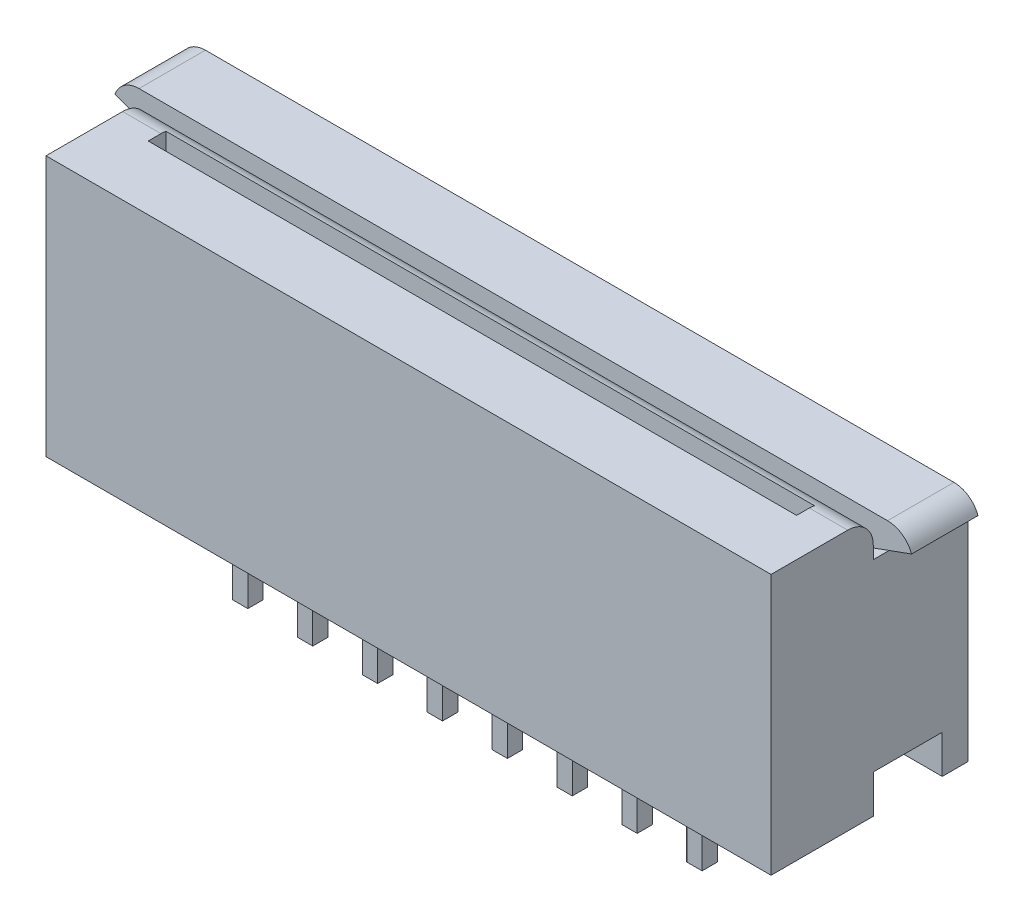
ISO-10303-21;
HEADER;
FILE_DESCRIPTION(('STEP AP214'),'2;1');
FILE_NAME('part.step','',(''),(''),'','','');
FILE_SCHEMA(('AUTOMOTIVE_DESIGN { 1 0 10303 214 1 1 1 1 }'));
ENDSEC;
DATA;
#1=APPLICATION_CONTEXT('core data for automotive mechanical design processes');
#2=APPLICATION_PROTOCOL_DEFINITION('international standard','automotive_design',2000,#1);
#3=PRODUCT_CONTEXT('',#1,'mechanical');
#4=PRODUCT('Part','Part','',(#3));
#5=PRODUCT_RELATED_PRODUCT_CATEGORY('part','',(#4));
#6=PRODUCT_DEFINITION_FORMATION('','',#4);
#7=PRODUCT_DEFINITION_CONTEXT('part definition',#1,'design');
#8=PRODUCT_DEFINITION('design','',#6,#7);
#9=PRODUCT_DEFINITION_SHAPE('','',#8);
#10=(LENGTH_UNIT() NAMED_UNIT(*) SI_UNIT(.MILLI.,.METRE.));
#11=(NAMED_UNIT(*) PLANE_ANGLE_UNIT() SI_UNIT($,.RADIAN.));
#12=(NAMED_UNIT(*) SI_UNIT($,.STERADIAN.) SOLID_ANGLE_UNIT());
#13=UNCERTAINTY_MEASURE_WITH_UNIT(LENGTH_MEASURE(1.E-05),#10,'distance_accuracy_value','');
#14=(GEOMETRIC_REPRESENTATION_CONTEXT(3) GLOBAL_UNCERTAINTY_ASSIGNED_CONTEXT((#13)) GLOBAL_UNIT_ASSIGNED_CONTEXT((#10,
#11,#12)) REPRESENTATION_CONTEXT('',''));
#15=CARTESIAN_POINT('',(0.,0.,0.));
#16=DIRECTION('',(0.,0.,1.));
#17=DIRECTION('',(1.,0.,0.));
#18=AXIS2_PLACEMENT_3D('',#15,#16,#17);
#19=CARTESIAN_POINT('',(23.08,0.,2.6));
#20=DIRECTION('',(0.,1.,0.));
#21=DIRECTION('',(0.,0.,1.));
#22=AXIS2_PLACEMENT_3D('',#19,#20,#21);
#23=PLANE('',#22);
#24=DIRECTION('',(0.,0.,-1.));
#25=VECTOR('',#24,1.);
#26=CARTESIAN_POINT('',(17.48,0.,0.3));
#27=LINE('',#26,#25);
#28=CARTESIAN_POINT('',(17.48,0.,0.3));
#29=VERTEX_POINT('',#28);
#30=CARTESIAN_POINT('',(17.48,0.,-0.3));
#31=VERTEX_POINT('',#30);
#32=EDGE_CURVE('E805',#29,#31,#27,.T.);
#33=ORIENTED_EDGE('',*,*,#32,.F.);
#34=DIRECTION('',(-1.,0.,0.));
#35=VECTOR('',#34,1.);
#36=CARTESIAN_POINT('',(17.48,0.,0.3));
#37=LINE('',#36,#35);
#38=CARTESIAN_POINT('',(18.08,0.,0.3));
#39=VERTEX_POINT('',#38);
#40=EDGE_CURVE('E807',#39,#29,#37,.T.);
#41=ORIENTED_EDGE('',*,*,#40,.F.);
#42=DIRECTION('',(0.,0.,1.));
#43=VECTOR('',#42,1.);
#44=CARTESIAN_POINT('',(18.08,0.,0.3));
#45=LINE('',#44,#43);
#46=CARTESIAN_POINT('',(18.08,0.,-0.299999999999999));
#47=VERTEX_POINT('',#46);
#48=EDGE_CURVE('E810',#47,#39,#45,.T.);
#49=ORIENTED_EDGE('',*,*,#48,.F.);
#50=DIRECTION('',(1.,0.,0.));
#51=VECTOR('',#50,1.);
#52=CARTESIAN_POINT('',(17.48,0.,-0.3));
#53=LINE('',#52,#51);
#54=EDGE_CURVE('E812',#31,#47,#53,.T.);
#55=ORIENTED_EDGE('',*,*,#54,.F.);
#56=EDGE_LOOP('',(#33,#41,#49,#55));
#57=FACE_BOUND('',#56,.T.);
#58=DIRECTION('',(0.,0.,-1.));
#59=VECTOR('',#58,1.);
#60=CARTESIAN_POINT('',(14.94,0.,0.3));
#61=LINE('',#60,#59);
#62=CARTESIAN_POINT('',(14.94,0.,0.3));
#63=VERTEX_POINT('',#62);
#64=CARTESIAN_POINT('',(14.94,0.,-0.3));
#65=VERTEX_POINT('',#64);
#66=EDGE_CURVE('E770',#63,#65,#61,.T.);
#67=ORIENTED_EDGE('',*,*,#66,.F.);
#68=DIRECTION('',(-1.,0.,0.));
#69=VECTOR('',#68,1.);
#70=CARTESIAN_POINT('',(14.94,0.,0.3));
#71=LINE('',#70,#69);
#72=CARTESIAN_POINT('',(15.54,0.,0.3));
#73=VERTEX_POINT('',#72);
#74=EDGE_CURVE('E772',#73,#63,#71,.T.);
#75=ORIENTED_EDGE('',*,*,#74,.F.);
#76=DIRECTION('',(0.,0.,1.));
#77=VECTOR('',#76,1.);
#78=CARTESIAN_POINT('',(15.54,0.,0.3));
#79=LINE('',#78,#77);
#80=CARTESIAN_POINT('',(15.54,0.,-0.299999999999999));
#81=VERTEX_POINT('',#80);
#82=EDGE_CURVE('E775',#81,#73,#79,.T.);
#83=ORIENTED_EDGE('',*,*,#82,.F.);
#84=DIRECTION('',(1.,0.,0.));
#85=VECTOR('',#84,1.);
#86=CARTESIAN_POINT('',(14.94,0.,-0.3));
#87=LINE('',#86,#85);
#88=EDGE_CURVE('E778',#65,#81,#87,.T.);
#89=ORIENTED_EDGE('',*,*,#88,.F.);
#90=EDGE_LOOP('',(#67,#75,#83,#89));
#91=FACE_BOUND('',#90,.T.);
#92=DIRECTION('',(0.,0.,-1.));
#93=VECTOR('',#92,1.);
#94=CARTESIAN_POINT('',(12.4,0.,0.3));
#95=LINE('',#94,#93);
#96=CARTESIAN_POINT('',(12.4,0.,0.3));
#97=VERTEX_POINT('',#96);
#98=CARTESIAN_POINT('',(12.4,0.,-0.3));
#99=VERTEX_POINT('',#98);
#100=EDGE_CURVE('E735',#97,#99,#95,.T.);
#101=ORIENTED_EDGE('',*,*,#100,.F.);
#102=DIRECTION('',(-1.,0.,0.));
#103=VECTOR('',#102,1.);
#104=CARTESIAN_POINT('',(12.4,0.,0.3));
#105=LINE('',#104,#103);
#106=CARTESIAN_POINT('',(13.,0.,0.3));
#107=VERTEX_POINT('',#106);
#108=EDGE_CURVE('E737',#107,#97,#105,.T.);
#109=ORIENTED_EDGE('',*,*,#108,.F.);
#110=DIRECTION('',(0.,0.,1.));
#111=VECTOR('',#110,1.);
#112=CARTESIAN_POINT('',(13.,0.,0.3));
#113=LINE('',#112,#111);
#114=CARTESIAN_POINT('',(13.,0.,-0.299999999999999));
#115=VERTEX_POINT('',#114);
#116=EDGE_CURVE('E740',#115,#107,#113,.T.);
#117=ORIENTED_EDGE('',*,*,#116,.F.);
#118=DIRECTION('',(1.,0.,0.));
#119=VECTOR('',#118,1.);
#120=CARTESIAN_POINT('',(12.4,0.,-0.3));
#121=LINE('',#120,#119);
#122=EDGE_CURVE('E743',#99,#115,#121,.T.);
#123=ORIENTED_EDGE('',*,*,#122,.F.);
#124=EDGE_LOOP('',(#101,#109,#117,#123));
#125=FACE_BOUND('',#124,.T.);
#126=DIRECTION('',(0.,0.,-1.));
#127=VECTOR('',#126,1.);
#128=CARTESIAN_POINT('',(9.86,0.,0.3));
#129=LINE('',#128,#127);
#130=CARTESIAN_POINT('',(9.86,0.,0.3));
#131=VERTEX_POINT('',#130);
#132=CARTESIAN_POINT('',(9.86,0.,-0.3));
#133=VERTEX_POINT('',#132);
#134=EDGE_CURVE('E700',#131,#133,#129,.T.);
#135=ORIENTED_EDGE('',*,*,#134,.F.);
#136=DIRECTION('',(-1.,0.,0.));
#137=VECTOR('',#136,1.);
#138=CARTESIAN_POINT('',(9.86,0.,0.3));
#139=LINE('',#138,#137);
#140=CARTESIAN_POINT('',(10.46,0.,0.3));
#141=VERTEX_POINT('',#140);
#142=EDGE_CURVE('E702',#141,#131,#139,.T.);
#143=ORIENTED_EDGE('',*,*,#142,.F.);
#144=DIRECTION('',(0.,0.,1.));
#145=VECTOR('',#144,1.);
#146=CARTESIAN_POINT('',(10.46,0.,0.3));
#147=LINE('',#146,#145);
#148=CARTESIAN_POINT('',(10.46,0.,-0.299999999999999));
#149=VERTEX_POINT('',#148);
#150=EDGE_CURVE('E705',#149,#141,#147,.T.);
#151=ORIENTED_EDGE('',*,*,#150,.F.);
#152=DIRECTION('',(1.,0.,0.));
#153=VECTOR('',#152,1.);
#154=CARTESIAN_POINT('',(9.86,0.,-0.3));
#155=LINE('',#154,#153);
#156=EDGE_CURVE('E708',#133,#149,#155,.T.);
#157=ORIENTED_EDGE('',*,*,#156,.F.);
#158=EDGE_LOOP('',(#135,#143,#151,#157));
#159=FACE_BOUND('',#158,.T.);
#160=DIRECTION('',(0.,0.,-1.));
#161=VECTOR('',#160,1.);
#162=CARTESIAN_POINT('',(7.32,0.,0.3));
#163=LINE('',#162,#161);
#164=CARTESIAN_POINT('',(7.32,0.,0.3));
#165=VERTEX_POINT('',#164);
#166=CARTESIAN_POINT('',(7.32,0.,-0.3));
#167=VERTEX_POINT('',#166);
#168=EDGE_CURVE('E665',#165,#167,#163,.T.);
#169=ORIENTED_EDGE('',*,*,#168,.F.);
#170=DIRECTION('',(-1.,0.,0.));
#171=VECTOR('',#170,1.);
#172=CARTESIAN_POINT('',(7.32,0.,0.3));
#173=LINE('',#172,#171);
#174=CARTESIAN_POINT('',(7.92,0.,0.3));
#175=VERTEX_POINT('',#174);
#176=EDGE_CURVE('E667',#175,#165,#173,.T.);
#177=ORIENTED_EDGE('',*,*,#176,.F.);
#178=DIRECTION('',(0.,0.,1.));
#179=VECTOR('',#178,1.);
#180=CARTESIAN_POINT('',(7.92,0.,0.3));
#181=LINE('',#180,#179);
#182=CARTESIAN_POINT('',(7.92,0.,-0.299999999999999));
#183=VERTEX_POINT('',#182);
#184=EDGE_CURVE('E670',#183,#175,#181,.T.);
#185=ORIENTED_EDGE('',*,*,#184,.F.);
#186=DIRECTION('',(1.,0.,0.));
#187=VECTOR('',#186,1.);
#188=CARTESIAN_POINT('',(7.32,0.,-0.3));
#189=LINE('',#188,#187);
#190=EDGE_CURVE('E673',#167,#183,#189,.T.);
#191=ORIENTED_EDGE('',*,*,#190,.F.);
#192=EDGE_LOOP('',(#169,#177,#185,#191));
#193=FACE_BOUND('',#192,.T.);
#194=DIRECTION('',(0.,0.,-1.));
#195=VECTOR('',#194,1.);
#196=CARTESIAN_POINT('',(4.78,0.,0.3));
#197=LINE('',#196,#195);
#198=CARTESIAN_POINT('',(4.78,0.,0.3));
#199=VERTEX_POINT('',#198);
#200=CARTESIAN_POINT('',(4.78,0.,-0.3));
#201=VERTEX_POINT('',#200);
#202=EDGE_CURVE('E630',#199,#201,#197,.T.);
#203=ORIENTED_EDGE('',*,*,#202,.F.);
#204=DIRECTION('',(-1.,0.,0.));
#205=VECTOR('',#204,1.);
#206=CARTESIAN_POINT('',(4.78,0.,0.3));
#207=LINE('',#206,#205);
#208=CARTESIAN_POINT('',(5.38,0.,0.3));
#209=VERTEX_POINT('',#208);
#210=EDGE_CURVE('E632',#209,#199,#207,.T.);
#211=ORIENTED_EDGE('',*,*,#210,.F.);
#212=DIRECTION('',(0.,0.,1.));
#213=VECTOR('',#212,1.);
#214=CARTESIAN_POINT('',(5.38,0.,0.3));
#215=LINE('',#214,#213);
#216=CARTESIAN_POINT('',(5.38,0.,-0.299999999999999));
#217=VERTEX_POINT('',#216);
#218=EDGE_CURVE('E635',#217,#209,#215,.T.);
#219=ORIENTED_EDGE('',*,*,#218,.F.);
#220=DIRECTION('',(1.,0.,0.));
#221=VECTOR('',#220,1.);
#222=CARTESIAN_POINT('',(4.78,0.,-0.3));
#223=LINE('',#222,#221);
#224=EDGE_CURVE('E638',#201,#217,#223,.T.);
#225=ORIENTED_EDGE('',*,*,#224,.F.);
#226=EDGE_LOOP('',(#203,#211,#219,#225));
#227=FACE_BOUND('',#226,.T.);
#228=DIRECTION('',(0.,0.,-1.));
#229=VECTOR('',#228,1.);
#230=CARTESIAN_POINT('',(2.24,0.,0.3));
#231=LINE('',#230,#229);
#232=CARTESIAN_POINT('',(2.24,0.,0.3));
#233=VERTEX_POINT('',#232);
#234=CARTESIAN_POINT('',(2.24,0.,-0.3));
#235=VERTEX_POINT('',#234);
#236=EDGE_CURVE('E411',#233,#235,#231,.T.);
#237=ORIENTED_EDGE('',*,*,#236,.F.);
#238=DIRECTION('',(-1.,0.,0.));
#239=VECTOR('',#238,1.);
#240=CARTESIAN_POINT('',(2.24,0.,0.3));
#241=LINE('',#240,#239);
#242=CARTESIAN_POINT('',(2.84,0.,0.3));
#243=VERTEX_POINT('',#242);
#244=EDGE_CURVE('E397',#243,#233,#241,.T.);
#245=ORIENTED_EDGE('',*,*,#244,.F.);
#246=DIRECTION('',(0.,0.,1.));
#247=VECTOR('',#246,1.);
#248=CARTESIAN_POINT('',(2.84,0.,0.3));
#249=LINE('',#248,#247);
#250=CARTESIAN_POINT('',(2.84,0.,-0.299999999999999));
#251=VERTEX_POINT('',#250);
#252=EDGE_CURVE('E1617',#251,#243,#249,.T.);
#253=ORIENTED_EDGE('',*,*,#252,.F.);
#254=DIRECTION('',(1.,0.,0.));
#255=VECTOR('',#254,1.);
#256=CARTESIAN_POINT('',(2.24,0.,-0.3));
#257=LINE('',#256,#255);
#258=EDGE_CURVE('E412',#235,#251,#257,.T.);
#259=ORIENTED_EDGE('',*,*,#258,.F.);
#260=EDGE_LOOP('',(#237,#245,#253,#259));
#261=FACE_BOUND('',#260,.T.);
#262=DIRECTION('',(-1.,0.,0.));
#263=VECTOR('',#262,1.);
#264=CARTESIAN_POINT('',(23.08,0.,2.6));
#265=LINE('',#264,#263);
#266=CARTESIAN_POINT('',(23.08,0.,2.6));
#267=VERTEX_POINT('',#266);
#268=CARTESIAN_POINT('',(-5.3,0.,2.6));
#269=VERTEX_POINT('',#268);
#270=EDGE_CURVE('E616',#267,#269,#265,.T.);
#271=ORIENTED_EDGE('',*,*,#270,.T.);
#272=DIRECTION('',(0.,0.,-1.));
#273=VECTOR('',#272,1.);
#274=CARTESIAN_POINT('',(-5.3,0.,2.6));
#275=LINE('',#274,#273);
#276=CARTESIAN_POINT('',(-5.3,0.,-1.4));
#277=VERTEX_POINT('',#276);
#278=EDGE_CURVE('E541',#269,#277,#275,.T.);
#279=ORIENTED_EDGE('',*,*,#278,.T.);
#280=DIRECTION('',(-1.,0.,0.));
#281=VECTOR('',#280,1.);
#282=CARTESIAN_POINT('',(23.08,0.,-1.4));
#283=LINE('',#282,#281);
#284=CARTESIAN_POINT('',(23.08,0.,-1.4));
#285=VERTEX_POINT('',#284);
#286=EDGE_CURVE('E614',#285,#277,#283,.T.);
#287=ORIENTED_EDGE('',*,*,#286,.F.);
#288=DIRECTION('',(0.,0.,-1.));
#289=VECTOR('',#288,1.);
#290=CARTESIAN_POINT('',(23.08,0.,2.6));
#291=LINE('',#290,#289);
#292=EDGE_CURVE('E574',#267,#285,#291,.T.);
#293=ORIENTED_EDGE('',*,*,#292,.F.);
#294=EDGE_LOOP('',(#271,#279,#287,#293));
#295=FACE_BOUND('',#294,.T.);
#296=DIRECTION('',(0.,0.,-1.));
#297=VECTOR('',#296,1.);
#298=CARTESIAN_POINT('',(-0.299999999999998,0.,0.3));
#299=LINE('',#298,#297);
#300=CARTESIAN_POINT('',(-0.299999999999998,0.,0.3));
#301=VERTEX_POINT('',#300);
#302=CARTESIAN_POINT('',(-0.299999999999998,0.,-0.3));
#303=VERTEX_POINT('',#302);
#304=EDGE_CURVE('E414',#301,#303,#299,.T.);
#305=ORIENTED_EDGE('',*,*,#304,.F.);
#306=DIRECTION('',(-1.,0.,0.));
#307=VECTOR('',#306,1.);
#308=CARTESIAN_POINT('',(-0.299999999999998,0.,0.3));
#309=LINE('',#308,#307);
#310=CARTESIAN_POINT('',(0.300000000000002,0.,0.3));
#311=VERTEX_POINT('',#310);
#312=EDGE_CURVE('E427',#311,#301,#309,.T.);
#313=ORIENTED_EDGE('',*,*,#312,.F.);
#314=DIRECTION('',(0.,0.,1.));
#315=VECTOR('',#314,1.);
#316=CARTESIAN_POINT('',(0.300000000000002,0.,0.3));
#317=LINE('',#316,#315);
#318=CARTESIAN_POINT('',(0.300000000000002,0.,-0.299999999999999));
#319=VERTEX_POINT('',#318);
#320=EDGE_CURVE('E424',#319,#311,#317,.T.);
#321=ORIENTED_EDGE('',*,*,#320,.F.);
#322=DIRECTION('',(1.,0.,0.));
#323=VECTOR('',#322,1.);
#324=CARTESIAN_POINT('',(-0.299999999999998,0.,-0.3));
#325=LINE('',#324,#323);
#326=EDGE_CURVE('E421',#303,#319,#325,.T.);
#327=ORIENTED_EDGE('',*,*,#326,.F.);
#328=EDGE_LOOP('',(#305,#313,#321,#327));
#329=FACE_BOUND('',#328,.T.);
#330=CARTESIAN_POINT('',(-2.54,0.,0.));
#331=DIRECTION('',(0.,1.,0.));
#332=DIRECTION('',(0.,0.,1.));
#333=AXIS2_PLACEMENT_3D('',#330,#331,#332);
#334=CIRCLE('',#333,0.750000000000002);
#335=CARTESIAN_POINT('',(-2.54,0.,0.750000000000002));
#336=VERTEX_POINT('',#335);
#337=EDGE_CURVE('E832',#336,#336,#334,.F.);
#338=ORIENTED_EDGE('',*,*,#337,.F.);
#339=EDGE_LOOP('',(#338));
#340=FACE_BOUND('',#339,.T.);
#341=ADVANCED_FACE('F30',(#57,#91,#125,#159,#193,#227,#261,#295,#329,#340),#23,.F.);
#342=CARTESIAN_POINT('',(23.08,8.7,-5.1));
#343=DIRECTION('',(0.,-1.,0.));
#344=DIRECTION('',(0.,0.,-1.));
#345=AXIS2_PLACEMENT_3D('',#342,#343,#344);
#346=PLANE('',#345);
#347=DIRECTION('',(-1.,0.,0.));
#348=VECTOR('',#347,1.);
#349=CARTESIAN_POINT('',(23.08,8.7,-5.1));
#350=LINE('',#349,#348);
#351=CARTESIAN_POINT('',(23.08,8.7,-5.1));
#352=VERTEX_POINT('',#351);
#353=CARTESIAN_POINT('',(-5.3,8.7,-5.1));
#354=VERTEX_POINT('',#353);
#355=EDGE_CURVE('E604',#352,#354,#350,.T.);
#356=ORIENTED_EDGE('',*,*,#355,.T.);
#357=DIRECTION('',(0.,0.,1.));
#358=VECTOR('',#357,1.);
#359=CARTESIAN_POINT('',(-5.3,8.7,-5.1));
#360=LINE('',#359,#358);
#361=CARTESIAN_POINT('',(-5.3,8.7,-1.4));
#362=VERTEX_POINT('',#361);
#363=EDGE_CURVE('E559',#354,#362,#360,.T.);
#364=ORIENTED_EDGE('',*,*,#363,.T.);
#365=DIRECTION('',(-1.,0.,0.));
#366=VECTOR('',#365,1.);
#367=CARTESIAN_POINT('',(23.08,8.7,-1.4));
#368=LINE('',#367,#366);
#369=CARTESIAN_POINT('',(23.08,8.7,-1.4));
#370=VERTEX_POINT('',#369);
#371=EDGE_CURVE('E602',#370,#362,#368,.T.);
#372=ORIENTED_EDGE('',*,*,#371,.F.);
#373=DIRECTION('',(0.,0.,1.));
#374=VECTOR('',#373,1.);
#375=CARTESIAN_POINT('',(23.08,8.7,-5.1));
#376=LINE('',#375,#374);
#377=EDGE_CURVE('E586',#352,#370,#376,.T.);
#378=ORIENTED_EDGE('',*,*,#377,.F.);
#379=EDGE_LOOP('',(#356,#364,#372,#378));
#380=FACE_BOUND('',#379,.T.);
#381=DIRECTION('',(1.,0.,0.));
#382=VECTOR('',#381,1.);
#383=CARTESIAN_POINT('',(-4.,8.7,-1.5));
#384=LINE('',#383,#382);
#385=CARTESIAN_POINT('',(-4.8,8.7,-1.5));
#386=VERTEX_POINT('',#385);
#387=CARTESIAN_POINT('',(22.6217424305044,8.7,-1.5));
#388=VERTEX_POINT('',#387);
#389=EDGE_CURVE('E516',#386,#388,#384,.T.);
#390=ORIENTED_EDGE('',*,*,#389,.F.);
#391=DIRECTION('',(0.,0.,-1.));
#392=VECTOR('',#391,1.);
#393=CARTESIAN_POINT('',(-4.8,8.7,-5.1));
#394=LINE('',#393,#392);
#395=CARTESIAN_POINT('',(-4.8,8.7,-4.1));
#396=VERTEX_POINT('',#395);
#397=EDGE_CURVE('E621',#386,#396,#394,.T.);
#398=ORIENTED_EDGE('',*,*,#397,.T.);
#399=DIRECTION('',(-1.,0.,0.));
#400=VECTOR('',#399,1.);
#401=CARTESIAN_POINT('',(-4.,8.7,-4.1));
#402=LINE('',#401,#400);
#403=CARTESIAN_POINT('',(22.6217424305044,8.7,-4.1));
#404=VERTEX_POINT('',#403);
#405=EDGE_CURVE('E532',#404,#396,#402,.T.);
#406=ORIENTED_EDGE('',*,*,#405,.F.);
#407=DIRECTION('',(0.,0.,1.));
#408=VECTOR('',#407,1.);
#409=CARTESIAN_POINT('',(22.6217424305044,8.7,-7.77967389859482));
#410=LINE('',#409,#408);
#411=EDGE_CURVE('E618',#404,#388,#410,.T.);
#412=ORIENTED_EDGE('',*,*,#411,.T.);
#413=EDGE_LOOP('',(#390,#398,#406,#412));
#414=FACE_BOUND('',#413,.T.);
#415=ADVANCED_FACE('F850',(#380,#414),#346,.F.);
#416=CARTESIAN_POINT('',(23.08,10.2,2.6));
#417=DIRECTION('',(0.,0.,-1.));
#418=DIRECTION('',(0.,1.,0.));
#419=AXIS2_PLACEMENT_3D('',#416,#417,#418);
#420=PLANE('',#419);
#421=DIRECTION('',(-1.,0.,0.));
#422=VECTOR('',#421,1.);
#423=CARTESIAN_POINT('',(23.08,10.2,2.6));
#424=LINE('',#423,#422);
#425=CARTESIAN_POINT('',(23.08,10.2,2.6));
#426=VERTEX_POINT('',#425);
#427=CARTESIAN_POINT('',(-5.3,10.2,2.6));
#428=VERTEX_POINT('',#427);
#429=EDGE_CURVE('E594',#426,#428,#424,.T.);
#430=ORIENTED_EDGE('',*,*,#429,.T.);
#431=DIRECTION('',(0.,-1.,0.));
#432=VECTOR('',#431,1.);
#433=CARTESIAN_POINT('',(-5.3,10.2,2.6));
#434=LINE('',#433,#432);
#435=EDGE_CURVE('E538',#428,#269,#434,.T.);
#436=ORIENTED_EDGE('',*,*,#435,.T.);
#437=ORIENTED_EDGE('',*,*,#270,.F.);
#438=DIRECTION('',(0.,-1.,0.));
#439=VECTOR('',#438,1.);
#440=CARTESIAN_POINT('',(23.08,10.2,2.6));
#441=LINE('',#440,#439);
#442=EDGE_CURVE('E571',#426,#267,#441,.T.);
#443=ORIENTED_EDGE('',*,*,#442,.F.);
#444=EDGE_LOOP('',(#430,#436,#437,#443));
#445=FACE_BOUND('',#444,.T.);
#446=ADVANCED_FACE('F856',(#445),#420,.F.);
#447=CARTESIAN_POINT('',(23.08,0.,-1.4));
#448=DIRECTION('',(0.,0.,1.));
#449=DIRECTION('',(1.,0.,0.));
#450=AXIS2_PLACEMENT_3D('',#447,#448,#449);
#451=PLANE('',#450);
#452=ORIENTED_EDGE('',*,*,#286,.T.);
#453=DIRECTION('',(0.,1.,0.));
#454=VECTOR('',#453,1.);
#455=CARTESIAN_POINT('',(-5.3,0.,-1.4));
#456=LINE('',#455,#454);
#457=CARTESIAN_POINT('',(-5.3,1.5,-1.4));
#458=VERTEX_POINT('',#457);
#459=EDGE_CURVE('E544',#277,#458,#456,.T.);
#460=ORIENTED_EDGE('',*,*,#459,.T.);
#461=DIRECTION('',(-1.,0.,0.));
#462=VECTOR('',#461,1.);
#463=CARTESIAN_POINT('',(23.08,1.5,-1.4));
#464=LINE('',#463,#462);
#465=CARTESIAN_POINT('',(23.08,1.5,-1.4));
#466=VERTEX_POINT('',#465);
#467=EDGE_CURVE('E612',#466,#458,#464,.T.);
#468=ORIENTED_EDGE('',*,*,#467,.F.);
#469=DIRECTION('',(0.,1.,0.));
#470=VECTOR('',#469,1.);
#471=CARTESIAN_POINT('',(23.08,0.,-1.4));
#472=LINE('',#471,#470);
#473=EDGE_CURVE('E576',#285,#466,#472,.T.);
#474=ORIENTED_EDGE('',*,*,#473,.F.);
#475=EDGE_LOOP('',(#452,#460,#468,#474));
#476=FACE_BOUND('',#475,.T.);
#477=ADVANCED_FACE('F862',(#476),#451,.F.);
#478=CARTESIAN_POINT('',(23.08,1.5,-1.4));
#479=DIRECTION('',(0.,1.,0.));
#480=DIRECTION('',(0.,0.,1.));
#481=AXIS2_PLACEMENT_3D('',#478,#479,#480);
#482=PLANE('',#481);
#483=ORIENTED_EDGE('',*,*,#467,.T.);
#484=DIRECTION('',(0.,0.,-1.));
#485=VECTOR('',#484,1.);
#486=CARTESIAN_POINT('',(-5.3,1.5,-1.4));
#487=LINE('',#486,#485);
#488=CARTESIAN_POINT('',(-5.3,1.5,-4.1));
#489=VERTEX_POINT('',#488);
#490=EDGE_CURVE('E547',#458,#489,#487,.T.);
#491=ORIENTED_EDGE('',*,*,#490,.T.);
#492=DIRECTION('',(-1.,0.,0.));
#493=VECTOR('',#492,1.);
#494=CARTESIAN_POINT('',(23.08,1.5,-4.1));
#495=LINE('',#494,#493);
#496=CARTESIAN_POINT('',(23.08,1.5,-4.1));
#497=VERTEX_POINT('',#496);
#498=EDGE_CURVE('E610',#497,#489,#495,.T.);
#499=ORIENTED_EDGE('',*,*,#498,.F.);
#500=DIRECTION('',(0.,0.,-1.));
#501=VECTOR('',#500,1.);
#502=CARTESIAN_POINT('',(23.08,1.5,-1.4));
#503=LINE('',#502,#501);
#504=EDGE_CURVE('E578',#466,#497,#503,.T.);
#505=ORIENTED_EDGE('',*,*,#504,.F.);
#506=EDGE_LOOP('',(#483,#491,#499,#505));
#507=FACE_BOUND('',#506,.T.);
#508=ADVANCED_FACE('F1338',(#507),#482,.F.);
#509=CARTESIAN_POINT('',(23.08,1.5,-4.1));
#510=DIRECTION('',(0.,0.,-1.));
#511=DIRECTION('',(-1.,0.,0.));
#512=AXIS2_PLACEMENT_3D('',#509,#510,#511);
#513=PLANE('',#512);
#514=ORIENTED_EDGE('',*,*,#498,.T.);
#515=DIRECTION('',(0.,-1.,0.));
#516=VECTOR('',#515,1.);
#517=CARTESIAN_POINT('',(-5.3,1.5,-4.1));
#518=LINE('',#517,#516);
#519=CARTESIAN_POINT('',(-5.3,0.,-4.1));
#520=VERTEX_POINT('',#519);
#521=EDGE_CURVE('E550',#489,#520,#518,.T.);
#522=ORIENTED_EDGE('',*,*,#521,.T.);
#523=DIRECTION('',(-1.,0.,0.));
#524=VECTOR('',#523,1.);
#525=CARTESIAN_POINT('',(23.08,0.,-4.1));
#526=LINE('',#525,#524);
#527=CARTESIAN_POINT('',(23.08,0.,-4.1));
#528=VERTEX_POINT('',#527);
#529=EDGE_CURVE('E608',#528,#520,#526,.T.);
#530=ORIENTED_EDGE('',*,*,#529,.F.);
#531=DIRECTION('',(0.,-1.,0.));
#532=VECTOR('',#531,1.);
#533=CARTESIAN_POINT('',(23.08,1.5,-4.1));
#534=LINE('',#533,#532);
#535=EDGE_CURVE('E580',#497,#528,#534,.T.);
#536=ORIENTED_EDGE('',*,*,#535,.F.);
#537=EDGE_LOOP('',(#514,#522,#530,#536));
#538=FACE_BOUND('',#537,.T.);
#539=ADVANCED_FACE('F1330',(#538),#513,.F.);
#540=CARTESIAN_POINT('',(23.08,0.,-4.1));
#541=DIRECTION('',(0.,1.,0.));
#542=DIRECTION('',(0.,0.,1.));
#543=AXIS2_PLACEMENT_3D('',#540,#541,#542);
#544=PLANE('',#543);
#545=ORIENTED_EDGE('',*,*,#529,.T.);
#546=DIRECTION('',(0.,0.,-1.));
#547=VECTOR('',#546,1.);
#548=CARTESIAN_POINT('',(-5.3,0.,-4.1));
#549=LINE('',#548,#547);
#550=CARTESIAN_POINT('',(-5.3,0.,-5.1));
#551=VERTEX_POINT('',#550);
#552=EDGE_CURVE('E553',#520,#551,#549,.T.);
#553=ORIENTED_EDGE('',*,*,#552,.T.);
#554=DIRECTION('',(-1.,0.,0.));
#555=VECTOR('',#554,1.);
#556=CARTESIAN_POINT('',(23.08,0.,-5.1));
#557=LINE('',#556,#555);
#558=CARTESIAN_POINT('',(23.08,0.,-5.1));
#559=VERTEX_POINT('',#558);
#560=EDGE_CURVE('E606',#559,#551,#557,.T.);
#561=ORIENTED_EDGE('',*,*,#560,.F.);
#562=DIRECTION('',(0.,0.,-1.));
#563=VECTOR('',#562,1.);
#564=CARTESIAN_POINT('',(23.08,0.,-4.1));
#565=LINE('',#564,#563);
#566=EDGE_CURVE('E582',#528,#559,#565,.T.);
#567=ORIENTED_EDGE('',*,*,#566,.F.);
#568=EDGE_LOOP('',(#545,#553,#561,#567));
#569=FACE_BOUND('',#568,.T.);
#570=ADVANCED_FACE('F1322',(#569),#544,.F.);
#571=CARTESIAN_POINT('',(23.08,0.,-5.1));
#572=DIRECTION('',(0.,0.,1.));
#573=DIRECTION('',(1.,0.,0.));
#574=AXIS2_PLACEMENT_3D('',#571,#572,#573);
#575=PLANE('',#574);
#576=ORIENTED_EDGE('',*,*,#560,.T.);
#577=DIRECTION('',(0.,1.,0.));
#578=VECTOR('',#577,1.);
#579=CARTESIAN_POINT('',(-5.3,0.,-5.1));
#580=LINE('',#579,#578);
#581=EDGE_CURVE('E556',#551,#354,#580,.T.);
#582=ORIENTED_EDGE('',*,*,#581,.T.);
#583=ORIENTED_EDGE('',*,*,#355,.F.);
#584=DIRECTION('',(0.,1.,0.));
#585=VECTOR('',#584,1.);
#586=CARTESIAN_POINT('',(23.08,0.,-5.1));
#587=LINE('',#586,#585);
#588=EDGE_CURVE('E584',#559,#352,#587,.T.);
#589=ORIENTED_EDGE('',*,*,#588,.F.);
#590=EDGE_LOOP('',(#576,#582,#583,#589));
#591=FACE_BOUND('',#590,.T.);
#592=ADVANCED_FACE('F1314',(#591),#575,.F.);
#593=CARTESIAN_POINT('',(23.08,8.7,-1.4));
#594=DIRECTION('',(0.,0.,1.));
#595=DIRECTION('',(0.,-1.,0.));
#596=AXIS2_PLACEMENT_3D('',#593,#594,#595);
#597=PLANE('',#596);
#598=ORIENTED_EDGE('',*,*,#371,.T.);
#599=DIRECTION('',(0.,1.,0.));
#600=VECTOR('',#599,1.);
#601=CARTESIAN_POINT('',(-5.3,8.7,-1.4));
#602=LINE('',#601,#600);
#603=CARTESIAN_POINT('',(-5.3,9.2,-1.4));
#604=VERTEX_POINT('',#603);
#605=EDGE_CURVE('E562',#362,#604,#602,.T.);
#606=ORIENTED_EDGE('',*,*,#605,.T.);
#607=DIRECTION('',(-1.,0.,0.));
#608=VECTOR('',#607,1.);
#609=CARTESIAN_POINT('',(23.08,9.2,-1.4));
#610=LINE('',#609,#608);
#611=CARTESIAN_POINT('',(23.08,9.2,-1.4));
#612=VERTEX_POINT('',#611);
#613=EDGE_CURVE('E600',#612,#604,#610,.T.);
#614=ORIENTED_EDGE('',*,*,#613,.F.);
#615=DIRECTION('',(0.,1.,0.));
#616=VECTOR('',#615,1.);
#617=CARTESIAN_POINT('',(23.08,8.7,-1.4));
#618=LINE('',#617,#616);
#619=EDGE_CURVE('E588',#370,#612,#618,.T.);
#620=ORIENTED_EDGE('',*,*,#619,.F.);
#621=EDGE_LOOP('',(#598,#606,#614,#620));
#622=FACE_BOUND('',#621,.T.);
#623=ADVANCED_FACE('F1307',(#622),#597,.F.);
#624=CARTESIAN_POINT('',(23.08,9.2,-0.4));
#625=DIRECTION('',(-1.,0.,0.));
#626=DIRECTION('',(0.,0.,1.));
#627=AXIS2_PLACEMENT_3D('',#624,#625,#626);
#628=CYLINDRICAL_SURFACE('',#627,1.);
#629=DIRECTION('',(-1.,0.,0.));
#630=VECTOR('',#629,1.);
#631=CARTESIAN_POINT('',(23.08,10.2,-0.4));
#632=LINE('',#631,#630);
#633=CARTESIAN_POINT('',(-3.8,10.2,-0.4));
#634=VERTEX_POINT('',#633);
#635=CARTESIAN_POINT('',(-5.3,10.2,-0.4));
#636=VERTEX_POINT('',#635);
#637=EDGE_CURVE('E596',#634,#636,#632,.T.);
#638=ORIENTED_EDGE('',*,*,#637,.F.);
#639=CARTESIAN_POINT('',(-3.8,9.2,-0.4));
#640=DIRECTION('',(-1.,0.,0.));
#641=DIRECTION('',(0.,0.,1.));
#642=AXIS2_PLACEMENT_3D('',#639,#640,#641);
#643=CIRCLE('',#642,1.);
#644=CARTESIAN_POINT('',(-3.8,10.1797958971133,-0.599999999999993));
#645=VERTEX_POINT('',#644);
#646=EDGE_CURVE('E481',#634,#645,#643,.T.);
#647=ORIENTED_EDGE('',*,*,#646,.T.);
#648=DIRECTION('',(-1.,0.,0.));
#649=VECTOR('',#648,1.);
#650=CARTESIAN_POINT('',(23.08,10.1797958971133,-0.599999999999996));
#651=LINE('',#650,#649);
#652=CARTESIAN_POINT('',(21.58,10.1797958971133,-0.599999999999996));
#653=VERTEX_POINT('',#652);
#654=EDGE_CURVE('E627',#645,#653,#651,.F.);
#655=ORIENTED_EDGE('',*,*,#654,.T.);
#656=CARTESIAN_POINT('',(21.58,9.2,-0.4));
#657=DIRECTION('',(1.,0.,0.));
#658=DIRECTION('',(0.,0.,-1.));
#659=AXIS2_PLACEMENT_3D('',#656,#657,#658);
#660=CIRCLE('',#659,1.);
#661=CARTESIAN_POINT('',(21.58,10.2,-0.4));
#662=VERTEX_POINT('',#661);
#663=EDGE_CURVE('E472',#653,#662,#660,.T.);
#664=ORIENTED_EDGE('',*,*,#663,.T.);
#665=CARTESIAN_POINT('',(23.08,10.2,-0.4));
#666=VERTEX_POINT('',#665);
#667=EDGE_CURVE('E597',#666,#662,#632,.T.);
#668=ORIENTED_EDGE('',*,*,#667,.F.);
#669=CARTESIAN_POINT('',(23.08,9.2,-0.4));
#670=DIRECTION('',(1.,0.,0.));
#671=DIRECTION('',(0.,0.,-1.));
#672=AXIS2_PLACEMENT_3D('',#669,#670,#671);
#673=CIRCLE('',#672,1.);
#674=EDGE_CURVE('E590',#612,#666,#673,.T.);
#675=ORIENTED_EDGE('',*,*,#674,.F.);
#676=ORIENTED_EDGE('',*,*,#613,.T.);
#677=CARTESIAN_POINT('',(-5.3,9.2,-0.4));
#678=DIRECTION('',(1.,0.,0.));
#679=DIRECTION('',(0.,0.,-1.));
#680=AXIS2_PLACEMENT_3D('',#677,#678,#679);
#681=CIRCLE('',#680,1.);
#682=EDGE_CURVE('E565',#604,#636,#681,.T.);
#683=ORIENTED_EDGE('',*,*,#682,.T.);
#684=EDGE_LOOP('',(#638,#647,#655,#664,#668,#675,#676,#683));
#685=FACE_BOUND('',#684,.T.);
#686=ADVANCED_FACE('F1300',(#685),#628,.T.);
#687=CARTESIAN_POINT('',(23.08,10.2,-0.4));
#688=DIRECTION('',(0.,-1.,0.));
#689=DIRECTION('',(0.,0.,-1.));
#690=AXIS2_PLACEMENT_3D('',#687,#688,#689);
#691=PLANE('',#690);
#692=DIRECTION('',(1.,0.,0.));
#693=VECTOR('',#692,1.);
#694=CARTESIAN_POINT('',(-3.8,10.2,0.100000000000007));
#695=LINE('',#694,#693);
#696=CARTESIAN_POINT('',(-3.8,10.2,0.100000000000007));
#697=VERTEX_POINT('',#696);
#698=CARTESIAN_POINT('',(21.58,10.2,0.100000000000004));
#699=VERTEX_POINT('',#698);
#700=EDGE_CURVE('E451',#697,#699,#695,.T.);
#701=ORIENTED_EDGE('',*,*,#700,.F.);
#702=DIRECTION('',(0.,0.,-1.));
#703=VECTOR('',#702,1.);
#704=CARTESIAN_POINT('',(-3.8,10.2,-0.4));
#705=LINE('',#704,#703);
#706=EDGE_CURVE('E624',#697,#634,#705,.T.);
#707=ORIENTED_EDGE('',*,*,#706,.T.);
#708=ORIENTED_EDGE('',*,*,#637,.T.);
#709=DIRECTION('',(0.,0.,1.));
#710=VECTOR('',#709,1.);
#711=CARTESIAN_POINT('',(-5.3,10.2,-0.4));
#712=LINE('',#711,#710);
#713=EDGE_CURVE('E568',#636,#428,#712,.T.);
#714=ORIENTED_EDGE('',*,*,#713,.T.);
#715=ORIENTED_EDGE('',*,*,#429,.F.);
#716=DIRECTION('',(0.,0.,1.));
#717=VECTOR('',#716,1.);
#718=CARTESIAN_POINT('',(23.08,10.2,-0.4));
#719=LINE('',#718,#717);
#720=EDGE_CURVE('E592',#666,#426,#719,.T.);
#721=ORIENTED_EDGE('',*,*,#720,.F.);
#722=ORIENTED_EDGE('',*,*,#667,.T.);
#723=DIRECTION('',(0.,0.,-1.));
#724=VECTOR('',#723,1.);
#725=CARTESIAN_POINT('',(21.58,10.2,-0.599999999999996));
#726=LINE('',#725,#724);
#727=EDGE_CURVE('E454',#699,#662,#726,.T.);
#728=ORIENTED_EDGE('',*,*,#727,.F.);
#729=EDGE_LOOP('',(#701,#707,#708,#714,#715,#721,#722,#728));
#730=FACE_BOUND('',#729,.T.);
#731=ADVANCED_FACE('F1292',(#730),#691,.F.);
#732=CARTESIAN_POINT('',(23.08,9.2,-0.4));
#733=DIRECTION('',(1.,0.,0.));
#734=DIRECTION('',(0.,0.,-1.));
#735=AXIS2_PLACEMENT_3D('',#732,#733,#734);
#736=PLANE('',#735);
#737=ORIENTED_EDGE('',*,*,#442,.T.);
#738=ORIENTED_EDGE('',*,*,#292,.T.);
#739=ORIENTED_EDGE('',*,*,#473,.T.);
#740=ORIENTED_EDGE('',*,*,#504,.T.);
#741=ORIENTED_EDGE('',*,*,#535,.T.);
#742=ORIENTED_EDGE('',*,*,#566,.T.);
#743=ORIENTED_EDGE('',*,*,#588,.T.);
#744=ORIENTED_EDGE('',*,*,#377,.T.);
#745=ORIENTED_EDGE('',*,*,#619,.T.);
#746=ORIENTED_EDGE('',*,*,#674,.T.);
#747=ORIENTED_EDGE('',*,*,#720,.T.);
#748=EDGE_LOOP('',(#737,#738,#739,#740,#741,#742,#743,#744,#745,#746,#747));
#749=FACE_BOUND('',#748,.T.);
#750=ADVANCED_FACE('F1284',(#749),#736,.T.);
#751=CARTESIAN_POINT('',(-5.3,9.2,-0.4));
#752=DIRECTION('',(1.,0.,0.));
#753=DIRECTION('',(0.,0.,-1.));
#754=AXIS2_PLACEMENT_3D('',#751,#752,#753);
#755=PLANE('',#754);
#756=ORIENTED_EDGE('',*,*,#435,.F.);
#757=ORIENTED_EDGE('',*,*,#713,.F.);
#758=ORIENTED_EDGE('',*,*,#682,.F.);
#759=ORIENTED_EDGE('',*,*,#605,.F.);
#760=ORIENTED_EDGE('',*,*,#363,.F.);
#761=ORIENTED_EDGE('',*,*,#581,.F.);
#762=ORIENTED_EDGE('',*,*,#552,.F.);
#763=ORIENTED_EDGE('',*,*,#521,.F.);
#764=ORIENTED_EDGE('',*,*,#490,.F.);
#765=ORIENTED_EDGE('',*,*,#459,.F.);
#766=ORIENTED_EDGE('',*,*,#278,.F.);
#767=EDGE_LOOP('',(#756,#757,#758,#759,#760,#761,#762,#763,#764,#765,#766));
#768=FACE_BOUND('',#767,.T.);
#769=ADVANCED_FACE('F1275',(#768),#755,.F.);
#770=CARTESIAN_POINT('',(-4.,10.2,-1.5));
#771=DIRECTION('',(0.,0.,-1.));
#772=DIRECTION('',(0.,1.,0.));
#773=AXIS2_PLACEMENT_3D('',#770,#771,#772);
#774=PLANE('',#773);
#775=ORIENTED_EDGE('',*,*,#389,.T.);
#776=CARTESIAN_POINT('',(23.08,8.5,-1.5));
#777=DIRECTION('',(0.,0.,-1.));
#778=DIRECTION('',(1.,0.,0.));
#779=AXIS2_PLACEMENT_3D('',#776,#777,#778);
#780=CIRCLE('',#779,0.499999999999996);
#781=CARTESIAN_POINT('',(22.9089899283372,8.96984631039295,-1.5));
#782=VERTEX_POINT('',#781);
#783=EDGE_CURVE('E493',#388,#782,#780,.T.);
#784=ORIENTED_EDGE('',*,*,#783,.T.);
#785=DIRECTION('',(0.939692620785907,0.342020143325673,0.));
#786=VECTOR('',#785,1.);
#787=CARTESIAN_POINT('',(24.48,9.54164721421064,-1.5));
#788=LINE('',#787,#786);
#789=CARTESIAN_POINT('',(24.48,9.54164721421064,-1.5));
#790=VERTEX_POINT('',#789);
#791=EDGE_CURVE('E518',#782,#790,#788,.T.);
#792=ORIENTED_EDGE('',*,*,#791,.T.);
#793=CARTESIAN_POINT('',(23.5397747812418,9.19943322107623,-1.5));
#794=DIRECTION('',(0.,0.,1.));
#795=DIRECTION('',(-1.,0.,0.));
#796=AXIS2_PLACEMENT_3D('',#793,#794,#795);
#797=CIRCLE('',#796,1.00056677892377);
#798=CARTESIAN_POINT('',(23.5397747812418,10.2,-1.5));
#799=VERTEX_POINT('',#798);
#800=EDGE_CURVE('E521',#790,#799,#797,.T.);
#801=ORIENTED_EDGE('',*,*,#800,.T.);
#802=DIRECTION('',(1.,0.,0.));
#803=VECTOR('',#802,1.);
#804=CARTESIAN_POINT('',(-4.,10.2,-1.5));
#805=LINE('',#804,#803);
#806=CARTESIAN_POINT('',(-5.75977478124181,10.2,-1.5));
#807=VERTEX_POINT('',#806);
#808=EDGE_CURVE('E534',#807,#799,#805,.T.);
#809=ORIENTED_EDGE('',*,*,#808,.F.);
#810=CARTESIAN_POINT('',(-5.75977478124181,9.19943322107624,-1.5));
#811=DIRECTION('',(0.,0.,1.));
#812=DIRECTION('',(1.,0.,0.));
#813=AXIS2_PLACEMENT_3D('',#810,#811,#812);
#814=CIRCLE('',#813,1.00056677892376);
#815=CARTESIAN_POINT('',(-6.7,9.54164721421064,-1.5));
#816=VERTEX_POINT('',#815);
#817=EDGE_CURVE('E484',#807,#816,#814,.T.);
#818=ORIENTED_EDGE('',*,*,#817,.T.);
#819=DIRECTION('',(0.939692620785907,-0.342020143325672,0.));
#820=VECTOR('',#819,1.);
#821=CARTESIAN_POINT('',(-6.7,9.54164721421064,-1.5));
#822=LINE('',#821,#820);
#823=CARTESIAN_POINT('',(-4.8,8.85010376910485,-1.5));
#824=VERTEX_POINT('',#823);
#825=EDGE_CURVE('E496',#816,#824,#822,.T.);
#826=ORIENTED_EDGE('',*,*,#825,.T.);
#827=DIRECTION('',(0.,-1.,0.));
#828=VECTOR('',#827,1.);
#829=CARTESIAN_POINT('',(-4.8,8.85010376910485,-1.5));
#830=LINE('',#829,#828);
#831=EDGE_CURVE('E499',#824,#386,#830,.T.);
#832=ORIENTED_EDGE('',*,*,#831,.T.);
#833=EDGE_LOOP('',(#775,#784,#792,#801,#809,#818,#826,#832));
#834=FACE_BOUND('',#833,.T.);
#835=ADVANCED_FACE('F1267',(#834),#774,.F.);
#836=CARTESIAN_POINT('',(-4.,10.2,-4.1));
#837=DIRECTION('',(0.,0.,1.));
#838=DIRECTION('',(0.,-1.,0.));
#839=AXIS2_PLACEMENT_3D('',#836,#837,#838);
#840=PLANE('',#839);
#841=ORIENTED_EDGE('',*,*,#405,.T.);
#842=DIRECTION('',(0.,1.,0.));
#843=VECTOR('',#842,1.);
#844=CARTESIAN_POINT('',(-4.8,8.85010376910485,-4.1));
#845=LINE('',#844,#843);
#846=CARTESIAN_POINT('',(-4.8,8.85010376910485,-4.1));
#847=VERTEX_POINT('',#846);
#848=EDGE_CURVE('E491',#396,#847,#845,.T.);
#849=ORIENTED_EDGE('',*,*,#848,.T.);
#850=DIRECTION('',(-0.939692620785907,0.342020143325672,0.));
#851=VECTOR('',#850,1.);
#852=CARTESIAN_POINT('',(-6.7,9.54164721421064,-4.1));
#853=LINE('',#852,#851);
#854=CARTESIAN_POINT('',(-6.7,9.54164721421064,-4.1));
#855=VERTEX_POINT('',#854);
#856=EDGE_CURVE('E488',#847,#855,#853,.T.);
#857=ORIENTED_EDGE('',*,*,#856,.T.);
#858=CARTESIAN_POINT('',(-5.75977478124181,9.19943322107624,-4.1));
#859=DIRECTION('',(0.,0.,1.));
#860=DIRECTION('',(0.,-1.,0.));
#861=AXIS2_PLACEMENT_3D('',#858,#859,#860);
#862=CIRCLE('',#861,1.00056677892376);
#863=CARTESIAN_POINT('',(-5.75977478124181,10.2,-4.1));
#864=VERTEX_POINT('',#863);
#865=EDGE_CURVE('E485',#855,#864,#862,.F.);
#866=ORIENTED_EDGE('',*,*,#865,.T.);
#867=DIRECTION('',(-1.,0.,0.));
#868=VECTOR('',#867,1.);
#869=CARTESIAN_POINT('',(-4.,10.2,-4.1));
#870=LINE('',#869,#868);
#871=CARTESIAN_POINT('',(23.5397747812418,10.2,-4.1));
#872=VERTEX_POINT('',#871);
#873=EDGE_CURVE('E536',#872,#864,#870,.T.);
#874=ORIENTED_EDGE('',*,*,#873,.F.);
#875=CARTESIAN_POINT('',(23.5397747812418,9.19943322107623,-4.1));
#876=DIRECTION('',(0.,0.,1.));
#877=DIRECTION('',(0.,-1.,0.));
#878=AXIS2_PLACEMENT_3D('',#875,#876,#877);
#879=CIRCLE('',#878,1.00056677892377);
#880=CARTESIAN_POINT('',(24.48,9.54164721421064,-4.1));
#881=VERTEX_POINT('',#880);
#882=EDGE_CURVE('E514',#872,#881,#879,.F.);
#883=ORIENTED_EDGE('',*,*,#882,.T.);
#884=DIRECTION('',(-0.939692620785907,-0.342020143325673,0.));
#885=VECTOR('',#884,1.);
#886=CARTESIAN_POINT('',(24.48,9.54164721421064,-4.1));
#887=LINE('',#886,#885);
#888=CARTESIAN_POINT('',(22.9089899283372,8.96984631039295,-4.1));
#889=VERTEX_POINT('',#888);
#890=EDGE_CURVE('E511',#881,#889,#887,.T.);
#891=ORIENTED_EDGE('',*,*,#890,.T.);
#892=CARTESIAN_POINT('',(23.08,8.5,-4.1));
#893=DIRECTION('',(0.,0.,1.));
#894=DIRECTION('',(0.,-1.,0.));
#895=AXIS2_PLACEMENT_3D('',#892,#893,#894);
#896=CIRCLE('',#895,0.499999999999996);
#897=EDGE_CURVE('E508',#889,#404,#896,.T.);
#898=ORIENTED_EDGE('',*,*,#897,.T.);
#899=EDGE_LOOP('',(#841,#849,#857,#866,#874,#883,#891,#898));
#900=FACE_BOUND('',#899,.T.);
#901=ADVANCED_FACE('F1259',(#900),#840,.F.);
#902=CARTESIAN_POINT('',(-4.,10.2,-1.5));
#903=DIRECTION('',(0.,1.,0.));
#904=DIRECTION('',(0.,0.,1.));
#905=AXIS2_PLACEMENT_3D('',#902,#903,#904);
#906=PLANE('',#905);
#907=ORIENTED_EDGE('',*,*,#873,.T.);
#908=DIRECTION('',(0.,0.,1.));
#909=VECTOR('',#908,1.);
#910=CARTESIAN_POINT('',(-5.75977478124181,10.2,-7.77967389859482));
#911=LINE('',#910,#909);
#912=EDGE_CURVE('E502',#864,#807,#911,.T.);
#913=ORIENTED_EDGE('',*,*,#912,.T.);
#914=ORIENTED_EDGE('',*,*,#808,.T.);
#915=DIRECTION('',(0.,0.,1.));
#916=VECTOR('',#915,1.);
#917=CARTESIAN_POINT('',(23.5397747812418,10.2,-7.77967389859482));
#918=LINE('',#917,#916);
#919=EDGE_CURVE('E512',#872,#799,#918,.T.);
#920=ORIENTED_EDGE('',*,*,#919,.F.);
#921=EDGE_LOOP('',(#907,#913,#914,#920));
#922=FACE_BOUND('',#921,.T.);
#923=ADVANCED_FACE('F1251',(#922),#906,.T.);
#924=CARTESIAN_POINT('',(23.08,8.5,-7.77967389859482));
#925=DIRECTION('',(0.,0.,1.));
#926=DIRECTION('',(1.,0.,0.));
#927=AXIS2_PLACEMENT_3D('',#924,#925,#926);
#928=CYLINDRICAL_SURFACE('',#927,0.499999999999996);
#929=ORIENTED_EDGE('',*,*,#411,.F.);
#930=ORIENTED_EDGE('',*,*,#897,.F.);
#931=DIRECTION('',(0.,0.,1.));
#932=VECTOR('',#931,1.);
#933=CARTESIAN_POINT('',(22.9089899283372,8.96984631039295,-7.77967389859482));
#934=LINE('',#933,#932);
#935=EDGE_CURVE('E524',#889,#782,#934,.T.);
#936=ORIENTED_EDGE('',*,*,#935,.T.);
#937=ORIENTED_EDGE('',*,*,#783,.F.);
#938=EDGE_LOOP('',(#929,#930,#936,#937));
#939=FACE_BOUND('',#938,.T.);
#940=ADVANCED_FACE('F1243',(#939),#928,.F.);
#941=CARTESIAN_POINT('',(23.5397747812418,9.19943322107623,-7.77967389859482));
#942=DIRECTION('',(0.,0.,1.));
#943=DIRECTION('',(1.,0.,0.));
#944=AXIS2_PLACEMENT_3D('',#941,#942,#943);
#945=CYLINDRICAL_SURFACE('',#944,1.00056677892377);
#946=ORIENTED_EDGE('',*,*,#882,.F.);
#947=ORIENTED_EDGE('',*,*,#919,.T.);
#948=ORIENTED_EDGE('',*,*,#800,.F.);
#949=DIRECTION('',(0.,0.,1.));
#950=VECTOR('',#949,1.);
#951=CARTESIAN_POINT('',(24.48,9.54164721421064,-7.77967389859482));
#952=LINE('',#951,#950);
#953=EDGE_CURVE('E527',#881,#790,#952,.T.);
#954=ORIENTED_EDGE('',*,*,#953,.F.);
#955=EDGE_LOOP('',(#946,#947,#948,#954));
#956=FACE_BOUND('',#955,.T.);
#957=ADVANCED_FACE('F1235',(#956),#945,.T.);
#958=CARTESIAN_POINT('',(24.48,9.54164721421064,-7.77967389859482));
#959=DIRECTION('',(0.342020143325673,-0.939692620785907,0.));
#960=DIRECTION('',(0.939692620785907,0.342020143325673,0.));
#961=AXIS2_PLACEMENT_3D('',#958,#959,#960);
#962=PLANE('',#961);
#963=ORIENTED_EDGE('',*,*,#890,.F.);
#964=ORIENTED_EDGE('',*,*,#953,.T.);
#965=ORIENTED_EDGE('',*,*,#791,.F.);
#966=ORIENTED_EDGE('',*,*,#935,.F.);
#967=EDGE_LOOP('',(#963,#964,#965,#966));
#968=FACE_BOUND('',#967,.T.);
#969=ADVANCED_FACE('F1227',(#968),#962,.T.);
#970=CARTESIAN_POINT('',(-4.8,8.85010376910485,-7.77967389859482));
#971=DIRECTION('',(-1.,0.,0.));
#972=DIRECTION('',(0.,0.,1.));
#973=AXIS2_PLACEMENT_3D('',#970,#971,#972);
#974=PLANE('',#973);
#975=ORIENTED_EDGE('',*,*,#397,.F.);
#976=ORIENTED_EDGE('',*,*,#831,.F.);
#977=DIRECTION('',(0.,0.,1.));
#978=VECTOR('',#977,1.);
#979=CARTESIAN_POINT('',(-4.8,8.85010376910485,-7.77967389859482));
#980=LINE('',#979,#978);
#981=EDGE_CURVE('E489',#847,#824,#980,.T.);
#982=ORIENTED_EDGE('',*,*,#981,.F.);
#983=ORIENTED_EDGE('',*,*,#848,.F.);
#984=EDGE_LOOP('',(#975,#976,#982,#983));
#985=FACE_BOUND('',#984,.T.);
#986=ADVANCED_FACE('F1219',(#985),#974,.T.);
#987=CARTESIAN_POINT('',(-6.7,9.54164721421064,-7.77967389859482));
#988=DIRECTION('',(-0.342020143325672,-0.939692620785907,0.));
#989=DIRECTION('',(0.939692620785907,-0.342020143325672,0.));
#990=AXIS2_PLACEMENT_3D('',#987,#988,#989);
#991=PLANE('',#990);
#992=ORIENTED_EDGE('',*,*,#856,.F.);
#993=ORIENTED_EDGE('',*,*,#981,.T.);
#994=ORIENTED_EDGE('',*,*,#825,.F.);
#995=DIRECTION('',(0.,0.,1.));
#996=VECTOR('',#995,1.);
#997=CARTESIAN_POINT('',(-6.7,9.54164721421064,-7.77967389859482));
#998=LINE('',#997,#996);
#999=EDGE_CURVE('E504',#855,#816,#998,.T.);
#1000=ORIENTED_EDGE('',*,*,#999,.F.);
#1001=EDGE_LOOP('',(#992,#993,#994,#1000));
#1002=FACE_BOUND('',#1001,.T.);
#1003=ADVANCED_FACE('F1210',(#1002),#991,.T.);
#1004=CARTESIAN_POINT('',(-5.75977478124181,9.19943322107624,-7.77967389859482));
#1005=DIRECTION('',(0.,0.,1.));
#1006=DIRECTION('',(1.,0.,0.));
#1007=AXIS2_PLACEMENT_3D('',#1004,#1005,#1006);
#1008=CYLINDRICAL_SURFACE('',#1007,1.00056677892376);
#1009=ORIENTED_EDGE('',*,*,#865,.F.);
#1010=ORIENTED_EDGE('',*,*,#999,.T.);
#1011=ORIENTED_EDGE('',*,*,#817,.F.);
#1012=ORIENTED_EDGE('',*,*,#912,.F.);
#1013=EDGE_LOOP('',(#1009,#1010,#1011,#1012));
#1014=FACE_BOUND('',#1013,.T.);
#1015=ADVANCED_FACE('F1201',(#1014),#1008,.T.);
#1016=CARTESIAN_POINT('',(-3.8,6.2,-0.599999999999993));
#1017=DIRECTION('',(0.,0.,-1.));
#1018=DIRECTION('',(-1.,0.,0.));
#1019=AXIS2_PLACEMENT_3D('',#1016,#1017,#1018);
#1020=PLANE('',#1019);
#1021=DIRECTION('',(0.,1.,0.));
#1022=VECTOR('',#1021,1.);
#1023=CARTESIAN_POINT('',(-3.8,6.2,-0.599999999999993));
#1024=LINE('',#1023,#1022);
#1025=CARTESIAN_POINT('',(-3.8,6.2,-0.599999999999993));
#1026=VERTEX_POINT('',#1025);
#1027=EDGE_CURVE('E469',#1026,#645,#1024,.T.);
#1028=ORIENTED_EDGE('',*,*,#1027,.F.);
#1029=DIRECTION('',(-1.,0.,0.));
#1030=VECTOR('',#1029,1.);
#1031=CARTESIAN_POINT('',(-3.8,6.2,-0.599999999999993));
#1032=LINE('',#1031,#1030);
#1033=CARTESIAN_POINT('',(21.58,6.2,-0.599999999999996));
#1034=VERTEX_POINT('',#1033);
#1035=EDGE_CURVE('E465',#1034,#1026,#1032,.T.);
#1036=ORIENTED_EDGE('',*,*,#1035,.F.);
#1037=DIRECTION('',(0.,1.,0.));
#1038=VECTOR('',#1037,1.);
#1039=CARTESIAN_POINT('',(21.58,6.2,-0.599999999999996));
#1040=LINE('',#1039,#1038);
#1041=EDGE_CURVE('E473',#1034,#653,#1040,.T.);
#1042=ORIENTED_EDGE('',*,*,#1041,.T.);
#1043=ORIENTED_EDGE('',*,*,#654,.F.);
#1044=EDGE_LOOP('',(#1028,#1036,#1042,#1043));
#1045=FACE_BOUND('',#1044,.T.);
#1046=ADVANCED_FACE('F1193',(#1045),#1020,.F.);
#1047=CARTESIAN_POINT('',(-3.8,6.2,-0.599999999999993));
#1048=DIRECTION('',(-1.,0.,0.));
#1049=DIRECTION('',(0.,0.,1.));
#1050=AXIS2_PLACEMENT_3D('',#1047,#1048,#1049);
#1051=PLANE('',#1050);
#1052=ORIENTED_EDGE('',*,*,#706,.F.);
#1053=DIRECTION('',(0.,1.,0.));
#1054=VECTOR('',#1053,1.);
#1055=CARTESIAN_POINT('',(-3.8,6.2,0.100000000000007));
#1056=LINE('',#1055,#1054);
#1057=CARTESIAN_POINT('',(-3.8,6.2,0.100000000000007));
#1058=VERTEX_POINT('',#1057);
#1059=EDGE_CURVE('E468',#1058,#697,#1056,.T.);
#1060=ORIENTED_EDGE('',*,*,#1059,.F.);
#1061=DIRECTION('',(0.,0.,1.));
#1062=VECTOR('',#1061,1.);
#1063=CARTESIAN_POINT('',(-3.8,6.2,-0.599999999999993));
#1064=LINE('',#1063,#1062);
#1065=EDGE_CURVE('E456',#1026,#1058,#1064,.T.);
#1066=ORIENTED_EDGE('',*,*,#1065,.F.);
#1067=ORIENTED_EDGE('',*,*,#1027,.T.);
#1068=ORIENTED_EDGE('',*,*,#646,.F.);
#1069=EDGE_LOOP('',(#1052,#1060,#1066,#1067,#1068));
#1070=FACE_BOUND('',#1069,.T.);
#1071=ADVANCED_FACE('F1185',(#1070),#1051,.F.);
#1072=CARTESIAN_POINT('',(21.58,6.2,-0.599999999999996));
#1073=DIRECTION('',(1.,0.,0.));
#1074=DIRECTION('',(0.,0.,-1.));
#1075=AXIS2_PLACEMENT_3D('',#1072,#1073,#1074);
#1076=PLANE('',#1075);
#1077=ORIENTED_EDGE('',*,*,#1041,.F.);
#1078=DIRECTION('',(0.,0.,-1.));
#1079=VECTOR('',#1078,1.);
#1080=CARTESIAN_POINT('',(21.58,6.2,-0.599999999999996));
#1081=LINE('',#1080,#1079);
#1082=CARTESIAN_POINT('',(21.58,6.2,0.100000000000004));
#1083=VERTEX_POINT('',#1082);
#1084=EDGE_CURVE('E462',#1083,#1034,#1081,.T.);
#1085=ORIENTED_EDGE('',*,*,#1084,.F.);
#1086=DIRECTION('',(0.,1.,0.));
#1087=VECTOR('',#1086,1.);
#1088=CARTESIAN_POINT('',(21.58,6.2,0.100000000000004));
#1089=LINE('',#1088,#1087);
#1090=EDGE_CURVE('E476',#1083,#699,#1089,.T.);
#1091=ORIENTED_EDGE('',*,*,#1090,.T.);
#1092=ORIENTED_EDGE('',*,*,#727,.T.);
#1093=ORIENTED_EDGE('',*,*,#663,.F.);
#1094=EDGE_LOOP('',(#1077,#1085,#1091,#1092,#1093));
#1095=FACE_BOUND('',#1094,.T.);
#1096=ADVANCED_FACE('F1177',(#1095),#1076,.F.);
#1097=CARTESIAN_POINT('',(-3.8,6.2,0.100000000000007));
#1098=DIRECTION('',(0.,0.,1.));
#1099=DIRECTION('',(1.,0.,0.));
#1100=AXIS2_PLACEMENT_3D('',#1097,#1098,#1099);
#1101=PLANE('',#1100);
#1102=ORIENTED_EDGE('',*,*,#700,.T.);
#1103=ORIENTED_EDGE('',*,*,#1090,.F.);
#1104=DIRECTION('',(1.,0.,0.));
#1105=VECTOR('',#1104,1.);
#1106=CARTESIAN_POINT('',(-3.8,6.2,0.100000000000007));
#1107=LINE('',#1106,#1105);
#1108=EDGE_CURVE('E459',#1058,#1083,#1107,.T.);
#1109=ORIENTED_EDGE('',*,*,#1108,.F.);
#1110=ORIENTED_EDGE('',*,*,#1059,.T.);
#1111=EDGE_LOOP('',(#1102,#1103,#1109,#1110));
#1112=FACE_BOUND('',#1111,.T.);
#1113=ADVANCED_FACE('F1169',(#1112),#1101,.F.);
#1114=CARTESIAN_POINT('',(-3.8,6.2,0.100000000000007));
#1115=DIRECTION('',(0.,1.,0.));
#1116=DIRECTION('',(0.,0.,1.));
#1117=AXIS2_PLACEMENT_3D('',#1114,#1115,#1116);
#1118=PLANE('',#1117);
#1119=ORIENTED_EDGE('',*,*,#1065,.T.);
#1120=ORIENTED_EDGE('',*,*,#1108,.T.);
#1121=ORIENTED_EDGE('',*,*,#1084,.T.);
#1122=ORIENTED_EDGE('',*,*,#1035,.T.);
#1123=EDGE_LOOP('',(#1119,#1120,#1121,#1122));
#1124=FACE_BOUND('',#1123,.T.);
#1125=ADVANCED_FACE('F1161',(#1124),#1118,.T.);
#1126=CARTESIAN_POINT('',(-0.299999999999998,-3.5,0.3));
#1127=DIRECTION('',(1.,0.,0.));
#1128=DIRECTION('',(0.,0.,-1.));
#1129=AXIS2_PLACEMENT_3D('',#1126,#1127,#1128);
#1130=PLANE('',#1129);
#1131=ORIENTED_EDGE('',*,*,#304,.T.);
#1132=DIRECTION('',(0.,1.,0.));
#1133=VECTOR('',#1132,1.);
#1134=CARTESIAN_POINT('',(-0.299999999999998,-3.5,-0.3));
#1135=LINE('',#1134,#1133);
#1136=CARTESIAN_POINT('',(-0.299999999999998,-3.5,-0.3));
#1137=VERTEX_POINT('',#1136);
#1138=EDGE_CURVE('E448',#1137,#303,#1135,.T.);
#1139=ORIENTED_EDGE('',*,*,#1138,.F.);
#1140=DIRECTION('',(0.,0.,-1.));
#1141=VECTOR('',#1140,1.);
#1142=CARTESIAN_POINT('',(-0.299999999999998,-3.5,0.3));
#1143=LINE('',#1142,#1141);
#1144=CARTESIAN_POINT('',(-0.299999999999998,-3.5,0.3));
#1145=VERTEX_POINT('',#1144);
#1146=EDGE_CURVE('E430',#1145,#1137,#1143,.T.);
#1147=ORIENTED_EDGE('',*,*,#1146,.F.);
#1148=DIRECTION('',(0.,1.,0.));
#1149=VECTOR('',#1148,1.);
#1150=CARTESIAN_POINT('',(-0.299999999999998,-3.5,0.3));
#1151=LINE('',#1150,#1149);
#1152=EDGE_CURVE('E439',#1145,#301,#1151,.T.);
#1153=ORIENTED_EDGE('',*,*,#1152,.T.);
#1154=EDGE_LOOP('',(#1131,#1139,#1147,#1153));
#1155=FACE_BOUND('',#1154,.T.);
#1156=ADVANCED_FACE('F1153',(#1155),#1130,.F.);
#1157=CARTESIAN_POINT('',(-0.299999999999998,-3.5,-0.3));
#1158=DIRECTION('',(0.,0.,1.));
#1159=DIRECTION('',(1.,0.,0.));
#1160=AXIS2_PLACEMENT_3D('',#1157,#1158,#1159);
#1161=PLANE('',#1160);
#1162=ORIENTED_EDGE('',*,*,#326,.T.);
#1163=DIRECTION('',(0.,1.,0.));
#1164=VECTOR('',#1163,1.);
#1165=CARTESIAN_POINT('',(0.300000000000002,-3.5,-0.3));
#1166=LINE('',#1165,#1164);
#1167=CARTESIAN_POINT('',(0.300000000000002,-3.5,-0.3));
#1168=VERTEX_POINT('',#1167);
#1169=EDGE_CURVE('E445',#1168,#319,#1166,.T.);
#1170=ORIENTED_EDGE('',*,*,#1169,.F.);
#1171=DIRECTION('',(1.,0.,0.));
#1172=VECTOR('',#1171,1.);
#1173=CARTESIAN_POINT('',(-0.299999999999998,-3.5,-0.3));
#1174=LINE('',#1173,#1172);
#1175=EDGE_CURVE('E433',#1137,#1168,#1174,.T.);
#1176=ORIENTED_EDGE('',*,*,#1175,.F.);
#1177=ORIENTED_EDGE('',*,*,#1138,.T.);
#1178=EDGE_LOOP('',(#1162,#1170,#1176,#1177));
#1179=FACE_BOUND('',#1178,.T.);
#1180=ADVANCED_FACE('F1145',(#1179),#1161,.F.);
#1181=CARTESIAN_POINT('',(0.300000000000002,-3.5,0.3));
#1182=DIRECTION('',(-1.,0.,0.));
#1183=DIRECTION('',(0.,0.,1.));
#1184=AXIS2_PLACEMENT_3D('',#1181,#1182,#1183);
#1185=PLANE('',#1184);
#1186=ORIENTED_EDGE('',*,*,#320,.T.);
#1187=DIRECTION('',(0.,1.,0.));
#1188=VECTOR('',#1187,1.);
#1189=CARTESIAN_POINT('',(0.300000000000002,-3.5,0.3));
#1190=LINE('',#1189,#1188);
#1191=CARTESIAN_POINT('',(0.300000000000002,-3.5,0.3));
#1192=VERTEX_POINT('',#1191);
#1193=EDGE_CURVE('E442',#1192,#311,#1190,.T.);
#1194=ORIENTED_EDGE('',*,*,#1193,.F.);
#1195=DIRECTION('',(0.,0.,1.));
#1196=VECTOR('',#1195,1.);
#1197=CARTESIAN_POINT('',(0.300000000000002,-3.5,0.3));
#1198=LINE('',#1197,#1196);
#1199=EDGE_CURVE('E435',#1168,#1192,#1198,.T.);
#1200=ORIENTED_EDGE('',*,*,#1199,.F.);
#1201=ORIENTED_EDGE('',*,*,#1169,.T.);
#1202=EDGE_LOOP('',(#1186,#1194,#1200,#1201));
#1203=FACE_BOUND('',#1202,.T.);
#1204=ADVANCED_FACE('F1137',(#1203),#1185,.F.);
#1205=CARTESIAN_POINT('',(-0.299999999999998,-3.5,0.3));
#1206=DIRECTION('',(0.,0.,-1.));
#1207=DIRECTION('',(-1.,0.,0.));
#1208=AXIS2_PLACEMENT_3D('',#1205,#1206,#1207);
#1209=PLANE('',#1208);
#1210=ORIENTED_EDGE('',*,*,#312,.T.);
#1211=ORIENTED_EDGE('',*,*,#1152,.F.);
#1212=DIRECTION('',(-1.,0.,0.));
#1213=VECTOR('',#1212,1.);
#1214=CARTESIAN_POINT('',(-0.299999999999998,-3.5,0.3));
#1215=LINE('',#1214,#1213);
#1216=EDGE_CURVE('E437',#1192,#1145,#1215,.T.);
#1217=ORIENTED_EDGE('',*,*,#1216,.F.);
#1218=ORIENTED_EDGE('',*,*,#1193,.T.);
#1219=EDGE_LOOP('',(#1210,#1211,#1217,#1218));
#1220=FACE_BOUND('',#1219,.T.);
#1221=ADVANCED_FACE('F1129',(#1220),#1209,.F.);
#1222=CARTESIAN_POINT('',(-0.299999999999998,-3.5,-0.3));
#1223=DIRECTION('',(0.,-1.,0.));
#1224=DIRECTION('',(0.,0.,-1.));
#1225=AXIS2_PLACEMENT_3D('',#1222,#1223,#1224);
#1226=PLANE('',#1225);
#1227=ORIENTED_EDGE('',*,*,#1146,.T.);
#1228=ORIENTED_EDGE('',*,*,#1175,.T.);
#1229=ORIENTED_EDGE('',*,*,#1199,.T.);
#1230=ORIENTED_EDGE('',*,*,#1216,.T.);
#1231=EDGE_LOOP('',(#1227,#1228,#1229,#1230));
#1232=FACE_BOUND('',#1231,.T.);
#1233=ADVANCED_FACE('F1096',(#1232),#1226,.T.);
#1234=CARTESIAN_POINT('',(2.24,-3.5,0.3));
#1235=DIRECTION('',(1.,0.,0.));
#1236=DIRECTION('',(0.,0.,-1.));
#1237=AXIS2_PLACEMENT_3D('',#1234,#1235,#1236);
#1238=PLANE('',#1237);
#1239=ORIENTED_EDGE('',*,*,#236,.T.);
#1240=DIRECTION('',(0.,1.,0.));
#1241=VECTOR('',#1240,1.);
#1242=CARTESIAN_POINT('',(2.24,-3.5,-0.3));
#1243=LINE('',#1242,#1241);
#1244=CARTESIAN_POINT('',(2.24,-3.5,-0.3));
#1245=VERTEX_POINT('',#1244);
#1246=EDGE_CURVE('E404',#1245,#235,#1243,.T.);
#1247=ORIENTED_EDGE('',*,*,#1246,.F.);
#1248=DIRECTION('',(0.,0.,-1.));
#1249=VECTOR('',#1248,1.);
#1250=CARTESIAN_POINT('',(2.24,-3.5,0.3));
#1251=LINE('',#1250,#1249);
#1252=CARTESIAN_POINT('',(2.24,-3.5,0.3));
#1253=VERTEX_POINT('',#1252);
#1254=EDGE_CURVE('E386',#1253,#1245,#1251,.T.);
#1255=ORIENTED_EDGE('',*,*,#1254,.F.);
#1256=DIRECTION('',(0.,1.,0.));
#1257=VECTOR('',#1256,1.);
#1258=CARTESIAN_POINT('',(2.24,-3.5,0.3));
#1259=LINE('',#1258,#1257);
#1260=EDGE_CURVE('E1622',#1253,#233,#1259,.T.);
#1261=ORIENTED_EDGE('',*,*,#1260,.T.);
#1262=EDGE_LOOP('',(#1239,#1247,#1255,#1261));
#1263=FACE_BOUND('',#1262,.T.);
#1264=ADVANCED_FACE('F410',(#1263),#1238,.F.);
#1265=CARTESIAN_POINT('',(2.24,-3.5,-0.3));
#1266=DIRECTION('',(0.,0.,1.));
#1267=DIRECTION('',(1.,0.,0.));
#1268=AXIS2_PLACEMENT_3D('',#1265,#1266,#1267);
#1269=PLANE('',#1268);
#1270=ORIENTED_EDGE('',*,*,#258,.T.);
#1271=DIRECTION('',(0.,1.,0.));
#1272=VECTOR('',#1271,1.);
#1273=CARTESIAN_POINT('',(2.84,-3.5,-0.3));
#1274=LINE('',#1273,#1272);
#1275=CARTESIAN_POINT('',(2.84,-3.5,-0.3));
#1276=VERTEX_POINT('',#1275);
#1277=EDGE_CURVE('E407',#1276,#251,#1274,.T.);
#1278=ORIENTED_EDGE('',*,*,#1277,.F.);
#1279=DIRECTION('',(1.,0.,0.));
#1280=VECTOR('',#1279,1.);
#1281=CARTESIAN_POINT('',(2.24,-3.5,-0.3));
#1282=LINE('',#1281,#1280);
#1283=EDGE_CURVE('E389',#1245,#1276,#1282,.T.);
#1284=ORIENTED_EDGE('',*,*,#1283,.F.);
#1285=ORIENTED_EDGE('',*,*,#1246,.T.);
#1286=EDGE_LOOP('',(#1270,#1278,#1284,#1285));
#1287=FACE_BOUND('',#1286,.T.);
#1288=ADVANCED_FACE('F403',(#1287),#1269,.F.);
#1289=CARTESIAN_POINT('',(2.84,-3.5,0.3));
#1290=DIRECTION('',(-1.,0.,0.));
#1291=DIRECTION('',(0.,0.,1.));
#1292=AXIS2_PLACEMENT_3D('',#1289,#1290,#1291);
#1293=PLANE('',#1292);
#1294=ORIENTED_EDGE('',*,*,#252,.T.);
#1295=DIRECTION('',(0.,1.,0.));
#1296=VECTOR('',#1295,1.);
#1297=CARTESIAN_POINT('',(2.84,-3.5,0.3));
#1298=LINE('',#1297,#1296);
#1299=CARTESIAN_POINT('',(2.84,-3.5,0.3));
#1300=VERTEX_POINT('',#1299);
#1301=EDGE_CURVE('E1619',#1300,#243,#1298,.T.);
#1302=ORIENTED_EDGE('',*,*,#1301,.F.);
#1303=DIRECTION('',(0.,0.,1.));
#1304=VECTOR('',#1303,1.);
#1305=CARTESIAN_POINT('',(2.84,-3.5,0.3));
#1306=LINE('',#1305,#1304);
#1307=EDGE_CURVE('E408',#1276,#1300,#1306,.T.);
#1308=ORIENTED_EDGE('',*,*,#1307,.F.);
#1309=ORIENTED_EDGE('',*,*,#1277,.T.);
#1310=EDGE_LOOP('',(#1294,#1302,#1308,#1309));
#1311=FACE_BOUND('',#1310,.T.);
#1312=ADVANCED_FACE('F1102',(#1311),#1293,.F.);
#1313=CARTESIAN_POINT('',(2.24,-3.5,0.3));
#1314=DIRECTION('',(0.,0.,-1.));
#1315=DIRECTION('',(-1.,0.,0.));
#1316=AXIS2_PLACEMENT_3D('',#1313,#1314,#1315);
#1317=PLANE('',#1316);
#1318=ORIENTED_EDGE('',*,*,#244,.T.);
#1319=ORIENTED_EDGE('',*,*,#1260,.F.);
#1320=DIRECTION('',(-1.,0.,0.));
#1321=VECTOR('',#1320,1.);
#1322=CARTESIAN_POINT('',(2.24,-3.5,0.3));
#1323=LINE('',#1322,#1321);
#1324=EDGE_CURVE('E392',#1300,#1253,#1323,.T.);
#1325=ORIENTED_EDGE('',*,*,#1324,.F.);
#1326=ORIENTED_EDGE('',*,*,#1301,.T.);
#1327=EDGE_LOOP('',(#1318,#1319,#1325,#1326));
#1328=FACE_BOUND('',#1327,.T.);
#1329=ADVANCED_FACE('F1094',(#1328),#1317,.F.);
#1330=CARTESIAN_POINT('',(2.24,-3.5,-0.3));
#1331=DIRECTION('',(0.,-1.,0.));
#1332=DIRECTION('',(0.,0.,-1.));
#1333=AXIS2_PLACEMENT_3D('',#1330,#1331,#1332);
#1334=PLANE('',#1333);
#1335=ORIENTED_EDGE('',*,*,#1254,.T.);
#1336=ORIENTED_EDGE('',*,*,#1283,.T.);
#1337=ORIENTED_EDGE('',*,*,#1307,.T.);
#1338=ORIENTED_EDGE('',*,*,#1324,.T.);
#1339=EDGE_LOOP('',(#1335,#1336,#1337,#1338));
#1340=FACE_BOUND('',#1339,.T.);
#1341=ADVANCED_FACE('F388',(#1340),#1334,.T.);
#1342=CARTESIAN_POINT('',(4.78,-3.5,-0.3));
#1343=DIRECTION('',(0.,-1.,0.));
#1344=DIRECTION('',(0.,0.,-1.));
#1345=AXIS2_PLACEMENT_3D('',#1342,#1343,#1344);
#1346=PLANE('',#1345);
#1347=DIRECTION('',(0.,0.,-1.));
#1348=VECTOR('',#1347,1.);
#1349=CARTESIAN_POINT('',(4.78,-3.5,0.3));
#1350=LINE('',#1349,#1348);
#1351=CARTESIAN_POINT('',(4.78,-3.5,0.3));
#1352=VERTEX_POINT('',#1351);
#1353=CARTESIAN_POINT('',(4.78,-3.5,-0.3));
#1354=VERTEX_POINT('',#1353);
#1355=EDGE_CURVE('E644',#1352,#1354,#1350,.T.);
#1356=ORIENTED_EDGE('',*,*,#1355,.T.);
#1357=DIRECTION('',(1.,0.,0.));
#1358=VECTOR('',#1357,1.);
#1359=CARTESIAN_POINT('',(4.78,-3.5,-0.3));
#1360=LINE('',#1359,#1358);
#1361=CARTESIAN_POINT('',(5.38,-3.5,-0.3));
#1362=VERTEX_POINT('',#1361);
#1363=EDGE_CURVE('E653',#1354,#1362,#1360,.T.);
#1364=ORIENTED_EDGE('',*,*,#1363,.T.);
#1365=DIRECTION('',(0.,0.,1.));
#1366=VECTOR('',#1365,1.);
#1367=CARTESIAN_POINT('',(5.38,-3.5,0.3));
#1368=LINE('',#1367,#1366);
#1369=CARTESIAN_POINT('',(5.38,-3.5,0.3));
#1370=VERTEX_POINT('',#1369);
#1371=EDGE_CURVE('E659',#1362,#1370,#1368,.T.);
#1372=ORIENTED_EDGE('',*,*,#1371,.T.);
#1373=DIRECTION('',(-1.,0.,0.));
#1374=VECTOR('',#1373,1.);
#1375=CARTESIAN_POINT('',(4.78,-3.5,0.3));
#1376=LINE('',#1375,#1374);
#1377=EDGE_CURVE('E662',#1370,#1352,#1376,.T.);
#1378=ORIENTED_EDGE('',*,*,#1377,.T.);
#1379=EDGE_LOOP('',(#1356,#1364,#1372,#1378));
#1380=FACE_BOUND('',#1379,.T.);
#1381=ADVANCED_FACE('F883',(#1380),#1346,.T.);
#1382=CARTESIAN_POINT('',(4.78,-3.5,0.3));
#1383=DIRECTION('',(0.,0.,-1.));
#1384=DIRECTION('',(-1.,0.,0.));
#1385=AXIS2_PLACEMENT_3D('',#1382,#1383,#1384);
#1386=PLANE('',#1385);
#1387=ORIENTED_EDGE('',*,*,#210,.T.);
#1388=DIRECTION('',(0.,1.,0.));
#1389=VECTOR('',#1388,1.);
#1390=CARTESIAN_POINT('',(4.78,-3.5,0.3));
#1391=LINE('',#1390,#1389);
#1392=EDGE_CURVE('E647',#1352,#199,#1391,.T.);
#1393=ORIENTED_EDGE('',*,*,#1392,.F.);
#1394=ORIENTED_EDGE('',*,*,#1377,.F.);
#1395=DIRECTION('',(0.,1.,0.));
#1396=VECTOR('',#1395,1.);
#1397=CARTESIAN_POINT('',(5.38,-3.5,0.3));
#1398=LINE('',#1397,#1396);
#1399=EDGE_CURVE('E656',#1370,#209,#1398,.T.);
#1400=ORIENTED_EDGE('',*,*,#1399,.T.);
#1401=EDGE_LOOP('',(#1387,#1393,#1394,#1400));
#1402=FACE_BOUND('',#1401,.T.);
#1403=ADVANCED_FACE('F879',(#1402),#1386,.F.);
#1404=CARTESIAN_POINT('',(5.38,-3.5,0.3));
#1405=DIRECTION('',(-1.,0.,0.));
#1406=DIRECTION('',(0.,0.,1.));
#1407=AXIS2_PLACEMENT_3D('',#1404,#1405,#1406);
#1408=PLANE('',#1407);
#1409=ORIENTED_EDGE('',*,*,#218,.T.);
#1410=ORIENTED_EDGE('',*,*,#1399,.F.);
#1411=ORIENTED_EDGE('',*,*,#1371,.F.);
#1412=DIRECTION('',(0.,1.,0.));
#1413=VECTOR('',#1412,1.);
#1414=CARTESIAN_POINT('',(5.38,-3.5,-0.3));
#1415=LINE('',#1414,#1413);
#1416=EDGE_CURVE('E650',#1362,#217,#1415,.T.);
#1417=ORIENTED_EDGE('',*,*,#1416,.T.);
#1418=EDGE_LOOP('',(#1409,#1410,#1411,#1417));
#1419=FACE_BOUND('',#1418,.T.);
#1420=ADVANCED_FACE('F875',(#1419),#1408,.F.);
#1421=CARTESIAN_POINT('',(4.78,-3.5,-0.3));
#1422=DIRECTION('',(0.,0.,1.));
#1423=DIRECTION('',(1.,0.,0.));
#1424=AXIS2_PLACEMENT_3D('',#1421,#1422,#1423);
#1425=PLANE('',#1424);
#1426=ORIENTED_EDGE('',*,*,#224,.T.);
#1427=ORIENTED_EDGE('',*,*,#1416,.F.);
#1428=ORIENTED_EDGE('',*,*,#1363,.F.);
#1429=DIRECTION('',(0.,1.,0.));
#1430=VECTOR('',#1429,1.);
#1431=CARTESIAN_POINT('',(4.78,-3.5,-0.3));
#1432=LINE('',#1431,#1430);
#1433=EDGE_CURVE('E641',#1354,#201,#1432,.T.);
#1434=ORIENTED_EDGE('',*,*,#1433,.T.);
#1435=EDGE_LOOP('',(#1426,#1427,#1428,#1434));
#1436=FACE_BOUND('',#1435,.T.);
#1437=ADVANCED_FACE('F871',(#1436),#1425,.F.);
#1438=CARTESIAN_POINT('',(4.78,-3.5,0.3));
#1439=DIRECTION('',(1.,0.,0.));
#1440=DIRECTION('',(0.,0.,-1.));
#1441=AXIS2_PLACEMENT_3D('',#1438,#1439,#1440);
#1442=PLANE('',#1441);
#1443=ORIENTED_EDGE('',*,*,#202,.T.);
#1444=ORIENTED_EDGE('',*,*,#1433,.F.);
#1445=ORIENTED_EDGE('',*,*,#1355,.F.);
#1446=ORIENTED_EDGE('',*,*,#1392,.T.);
#1447=EDGE_LOOP('',(#1443,#1444,#1445,#1446));
#1448=FACE_BOUND('',#1447,.T.);
#1449=ADVANCED_FACE('F867',(#1448),#1442,.F.);
#1450=CARTESIAN_POINT('',(7.32,-3.5,-0.3));
#1451=DIRECTION('',(0.,-1.,0.));
#1452=DIRECTION('',(0.,0.,-1.));
#1453=AXIS2_PLACEMENT_3D('',#1450,#1451,#1452);
#1454=PLANE('',#1453);
#1455=DIRECTION('',(0.,0.,-1.));
#1456=VECTOR('',#1455,1.);
#1457=CARTESIAN_POINT('',(7.32,-3.5,0.3));
#1458=LINE('',#1457,#1456);
#1459=CARTESIAN_POINT('',(7.32,-3.5,0.3));
#1460=VERTEX_POINT('',#1459);
#1461=CARTESIAN_POINT('',(7.32,-3.5,-0.3));
#1462=VERTEX_POINT('',#1461);
#1463=EDGE_CURVE('E679',#1460,#1462,#1458,.T.);
#1464=ORIENTED_EDGE('',*,*,#1463,.T.);
#1465=DIRECTION('',(1.,0.,0.));
#1466=VECTOR('',#1465,1.);
#1467=CARTESIAN_POINT('',(7.32,-3.5,-0.3));
#1468=LINE('',#1467,#1466);
#1469=CARTESIAN_POINT('',(7.92,-3.5,-0.3));
#1470=VERTEX_POINT('',#1469);
#1471=EDGE_CURVE('E688',#1462,#1470,#1468,.T.);
#1472=ORIENTED_EDGE('',*,*,#1471,.T.);
#1473=DIRECTION('',(0.,0.,1.));
#1474=VECTOR('',#1473,1.);
#1475=CARTESIAN_POINT('',(7.92,-3.5,0.3));
#1476=LINE('',#1475,#1474);
#1477=CARTESIAN_POINT('',(7.92,-3.5,0.3));
#1478=VERTEX_POINT('',#1477);
#1479=EDGE_CURVE('E694',#1470,#1478,#1476,.T.);
#1480=ORIENTED_EDGE('',*,*,#1479,.T.);
#1481=DIRECTION('',(-1.,0.,0.));
#1482=VECTOR('',#1481,1.);
#1483=CARTESIAN_POINT('',(7.32,-3.5,0.3));
#1484=LINE('',#1483,#1482);
#1485=EDGE_CURVE('E697',#1478,#1460,#1484,.T.);
#1486=ORIENTED_EDGE('',*,*,#1485,.T.);
#1487=EDGE_LOOP('',(#1464,#1472,#1480,#1486));
#1488=FACE_BOUND('',#1487,.T.);
#1489=ADVANCED_FACE('F870',(#1488),#1454,.T.);
#1490=CARTESIAN_POINT('',(7.32,-3.5,0.3));
#1491=DIRECTION('',(0.,0.,-1.));
#1492=DIRECTION('',(-1.,0.,0.));
#1493=AXIS2_PLACEMENT_3D('',#1490,#1491,#1492);
#1494=PLANE('',#1493);
#1495=ORIENTED_EDGE('',*,*,#176,.T.);
#1496=DIRECTION('',(0.,1.,0.));
#1497=VECTOR('',#1496,1.);
#1498=CARTESIAN_POINT('',(7.32,-3.5,0.3));
#1499=LINE('',#1498,#1497);
#1500=EDGE_CURVE('E682',#1460,#165,#1499,.T.);
#1501=ORIENTED_EDGE('',*,*,#1500,.F.);
#1502=ORIENTED_EDGE('',*,*,#1485,.F.);
#1503=DIRECTION('',(0.,1.,0.));
#1504=VECTOR('',#1503,1.);
#1505=CARTESIAN_POINT('',(7.92,-3.5,0.3));
#1506=LINE('',#1505,#1504);
#1507=EDGE_CURVE('E691',#1478,#175,#1506,.T.);
#1508=ORIENTED_EDGE('',*,*,#1507,.T.);
#1509=EDGE_LOOP('',(#1495,#1501,#1502,#1508));
#1510=FACE_BOUND('',#1509,.T.);
#1511=ADVANCED_FACE('F900',(#1510),#1494,.F.);
#1512=CARTESIAN_POINT('',(7.92,-3.5,0.3));
#1513=DIRECTION('',(-1.,0.,0.));
#1514=DIRECTION('',(0.,0.,1.));
#1515=AXIS2_PLACEMENT_3D('',#1512,#1513,#1514);
#1516=PLANE('',#1515);
#1517=ORIENTED_EDGE('',*,*,#184,.T.);
#1518=ORIENTED_EDGE('',*,*,#1507,.F.);
#1519=ORIENTED_EDGE('',*,*,#1479,.F.);
#1520=DIRECTION('',(0.,1.,0.));
#1521=VECTOR('',#1520,1.);
#1522=CARTESIAN_POINT('',(7.92,-3.5,-0.3));
#1523=LINE('',#1522,#1521);
#1524=EDGE_CURVE('E685',#1470,#183,#1523,.T.);
#1525=ORIENTED_EDGE('',*,*,#1524,.T.);
#1526=EDGE_LOOP('',(#1517,#1518,#1519,#1525));
#1527=FACE_BOUND('',#1526,.T.);
#1528=ADVANCED_FACE('F896',(#1527),#1516,.F.);
#1529=CARTESIAN_POINT('',(7.32,-3.5,-0.3));
#1530=DIRECTION('',(0.,0.,1.));
#1531=DIRECTION('',(1.,0.,0.));
#1532=AXIS2_PLACEMENT_3D('',#1529,#1530,#1531);
#1533=PLANE('',#1532);
#1534=ORIENTED_EDGE('',*,*,#190,.T.);
#1535=ORIENTED_EDGE('',*,*,#1524,.F.);
#1536=ORIENTED_EDGE('',*,*,#1471,.F.);
#1537=DIRECTION('',(0.,1.,0.));
#1538=VECTOR('',#1537,1.);
#1539=CARTESIAN_POINT('',(7.32,-3.5,-0.3));
#1540=LINE('',#1539,#1538);
#1541=EDGE_CURVE('E676',#1462,#167,#1540,.T.);
#1542=ORIENTED_EDGE('',*,*,#1541,.T.);
#1543=EDGE_LOOP('',(#1534,#1535,#1536,#1542));
#1544=FACE_BOUND('',#1543,.T.);
#1545=ADVANCED_FACE('F892',(#1544),#1533,.F.);
#1546=CARTESIAN_POINT('',(7.32,-3.5,0.3));
#1547=DIRECTION('',(1.,0.,0.));
#1548=DIRECTION('',(0.,0.,-1.));
#1549=AXIS2_PLACEMENT_3D('',#1546,#1547,#1548);
#1550=PLANE('',#1549);
#1551=ORIENTED_EDGE('',*,*,#168,.T.);
#1552=ORIENTED_EDGE('',*,*,#1541,.F.);
#1553=ORIENTED_EDGE('',*,*,#1463,.F.);
#1554=ORIENTED_EDGE('',*,*,#1500,.T.);
#1555=EDGE_LOOP('',(#1551,#1552,#1553,#1554));
#1556=FACE_BOUND('',#1555,.T.);
#1557=ADVANCED_FACE('F888',(#1556),#1550,.F.);
#1558=CARTESIAN_POINT('',(9.86,-3.5,-0.3));
#1559=DIRECTION('',(0.,-1.,0.));
#1560=DIRECTION('',(0.,0.,-1.));
#1561=AXIS2_PLACEMENT_3D('',#1558,#1559,#1560);
#1562=PLANE('',#1561);
#1563=DIRECTION('',(0.,0.,-1.));
#1564=VECTOR('',#1563,1.);
#1565=CARTESIAN_POINT('',(9.86,-3.5,0.3));
#1566=LINE('',#1565,#1564);
#1567=CARTESIAN_POINT('',(9.86,-3.5,0.3));
#1568=VERTEX_POINT('',#1567);
#1569=CARTESIAN_POINT('',(9.86,-3.5,-0.3));
#1570=VERTEX_POINT('',#1569);
#1571=EDGE_CURVE('E714',#1568,#1570,#1566,.T.);
#1572=ORIENTED_EDGE('',*,*,#1571,.T.);
#1573=DIRECTION('',(1.,0.,0.));
#1574=VECTOR('',#1573,1.);
#1575=CARTESIAN_POINT('',(9.86,-3.5,-0.3));
#1576=LINE('',#1575,#1574);
#1577=CARTESIAN_POINT('',(10.46,-3.5,-0.3));
#1578=VERTEX_POINT('',#1577);
#1579=EDGE_CURVE('E723',#1570,#1578,#1576,.T.);
#1580=ORIENTED_EDGE('',*,*,#1579,.T.);
#1581=DIRECTION('',(0.,0.,1.));
#1582=VECTOR('',#1581,1.);
#1583=CARTESIAN_POINT('',(10.46,-3.5,0.3));
#1584=LINE('',#1583,#1582);
#1585=CARTESIAN_POINT('',(10.46,-3.5,0.3));
#1586=VERTEX_POINT('',#1585);
#1587=EDGE_CURVE('E729',#1578,#1586,#1584,.T.);
#1588=ORIENTED_EDGE('',*,*,#1587,.T.);
#1589=DIRECTION('',(-1.,0.,0.));
#1590=VECTOR('',#1589,1.);
#1591=CARTESIAN_POINT('',(9.86,-3.5,0.3));
#1592=LINE('',#1591,#1590);
#1593=EDGE_CURVE('E732',#1586,#1568,#1592,.T.);
#1594=ORIENTED_EDGE('',*,*,#1593,.T.);
#1595=EDGE_LOOP('',(#1572,#1580,#1588,#1594));
#1596=FACE_BOUND('',#1595,.T.);
#1597=ADVANCED_FACE('F891',(#1596),#1562,.T.);
#1598=CARTESIAN_POINT('',(9.86,-3.5,0.3));
#1599=DIRECTION('',(0.,0.,-1.));
#1600=DIRECTION('',(-1.,0.,0.));
#1601=AXIS2_PLACEMENT_3D('',#1598,#1599,#1600);
#1602=PLANE('',#1601);
#1603=ORIENTED_EDGE('',*,*,#142,.T.);
#1604=DIRECTION('',(0.,1.,0.));
#1605=VECTOR('',#1604,1.);
#1606=CARTESIAN_POINT('',(9.86,-3.5,0.3));
#1607=LINE('',#1606,#1605);
#1608=EDGE_CURVE('E717',#1568,#131,#1607,.T.);
#1609=ORIENTED_EDGE('',*,*,#1608,.F.);
#1610=ORIENTED_EDGE('',*,*,#1593,.F.);
#1611=DIRECTION('',(0.,1.,0.));
#1612=VECTOR('',#1611,1.);
#1613=CARTESIAN_POINT('',(10.46,-3.5,0.3));
#1614=LINE('',#1613,#1612);
#1615=EDGE_CURVE('E726',#1586,#141,#1614,.T.);
#1616=ORIENTED_EDGE('',*,*,#1615,.T.);
#1617=EDGE_LOOP('',(#1603,#1609,#1610,#1616));
#1618=FACE_BOUND('',#1617,.T.);
#1619=ADVANCED_FACE('F920',(#1618),#1602,.F.);
#1620=CARTESIAN_POINT('',(10.46,-3.5,0.3));
#1621=DIRECTION('',(-1.,0.,0.));
#1622=DIRECTION('',(0.,0.,1.));
#1623=AXIS2_PLACEMENT_3D('',#1620,#1621,#1622);
#1624=PLANE('',#1623);
#1625=ORIENTED_EDGE('',*,*,#150,.T.);
#1626=ORIENTED_EDGE('',*,*,#1615,.F.);
#1627=ORIENTED_EDGE('',*,*,#1587,.F.);
#1628=DIRECTION('',(0.,1.,0.));
#1629=VECTOR('',#1628,1.);
#1630=CARTESIAN_POINT('',(10.46,-3.5,-0.3));
#1631=LINE('',#1630,#1629);
#1632=EDGE_CURVE('E720',#1578,#149,#1631,.T.);
#1633=ORIENTED_EDGE('',*,*,#1632,.T.);
#1634=EDGE_LOOP('',(#1625,#1626,#1627,#1633));
#1635=FACE_BOUND('',#1634,.T.);
#1636=ADVANCED_FACE('F916',(#1635),#1624,.F.);
#1637=CARTESIAN_POINT('',(9.86,-3.5,-0.3));
#1638=DIRECTION('',(0.,0.,1.));
#1639=DIRECTION('',(1.,0.,0.));
#1640=AXIS2_PLACEMENT_3D('',#1637,#1638,#1639);
#1641=PLANE('',#1640);
#1642=ORIENTED_EDGE('',*,*,#156,.T.);
#1643=ORIENTED_EDGE('',*,*,#1632,.F.);
#1644=ORIENTED_EDGE('',*,*,#1579,.F.);
#1645=DIRECTION('',(0.,1.,0.));
#1646=VECTOR('',#1645,1.);
#1647=CARTESIAN_POINT('',(9.86,-3.5,-0.3));
#1648=LINE('',#1647,#1646);
#1649=EDGE_CURVE('E711',#1570,#133,#1648,.T.);
#1650=ORIENTED_EDGE('',*,*,#1649,.T.);
#1651=EDGE_LOOP('',(#1642,#1643,#1644,#1650));
#1652=FACE_BOUND('',#1651,.T.);
#1653=ADVANCED_FACE('F912',(#1652),#1641,.F.);
#1654=CARTESIAN_POINT('',(9.86,-3.5,0.3));
#1655=DIRECTION('',(1.,0.,0.));
#1656=DIRECTION('',(0.,0.,-1.));
#1657=AXIS2_PLACEMENT_3D('',#1654,#1655,#1656);
#1658=PLANE('',#1657);
#1659=ORIENTED_EDGE('',*,*,#134,.T.);
#1660=ORIENTED_EDGE('',*,*,#1649,.F.);
#1661=ORIENTED_EDGE('',*,*,#1571,.F.);
#1662=ORIENTED_EDGE('',*,*,#1608,.T.);
#1663=EDGE_LOOP('',(#1659,#1660,#1661,#1662));
#1664=FACE_BOUND('',#1663,.T.);
#1665=ADVANCED_FACE('F908',(#1664),#1658,.F.);
#1666=CARTESIAN_POINT('',(12.4,-3.5,-0.3));
#1667=DIRECTION('',(0.,-1.,0.));
#1668=DIRECTION('',(0.,0.,-1.));
#1669=AXIS2_PLACEMENT_3D('',#1666,#1667,#1668);
#1670=PLANE('',#1669);
#1671=DIRECTION('',(0.,0.,-1.));
#1672=VECTOR('',#1671,1.);
#1673=CARTESIAN_POINT('',(12.4,-3.5,0.3));
#1674=LINE('',#1673,#1672);
#1675=CARTESIAN_POINT('',(12.4,-3.5,0.3));
#1676=VERTEX_POINT('',#1675);
#1677=CARTESIAN_POINT('',(12.4,-3.5,-0.3));
#1678=VERTEX_POINT('',#1677);
#1679=EDGE_CURVE('E749',#1676,#1678,#1674,.T.);
#1680=ORIENTED_EDGE('',*,*,#1679,.T.);
#1681=DIRECTION('',(1.,0.,0.));
#1682=VECTOR('',#1681,1.);
#1683=CARTESIAN_POINT('',(12.4,-3.5,-0.3));
#1684=LINE('',#1683,#1682);
#1685=CARTESIAN_POINT('',(13.,-3.5,-0.3));
#1686=VERTEX_POINT('',#1685);
#1687=EDGE_CURVE('E758',#1678,#1686,#1684,.T.);
#1688=ORIENTED_EDGE('',*,*,#1687,.T.);
#1689=DIRECTION('',(0.,0.,1.));
#1690=VECTOR('',#1689,1.);
#1691=CARTESIAN_POINT('',(13.,-3.5,0.3));
#1692=LINE('',#1691,#1690);
#1693=CARTESIAN_POINT('',(13.,-3.5,0.3));
#1694=VERTEX_POINT('',#1693);
#1695=EDGE_CURVE('E764',#1686,#1694,#1692,.T.);
#1696=ORIENTED_EDGE('',*,*,#1695,.T.);
#1697=DIRECTION('',(-1.,0.,0.));
#1698=VECTOR('',#1697,1.);
#1699=CARTESIAN_POINT('',(12.4,-3.5,0.3));
#1700=LINE('',#1699,#1698);
#1701=EDGE_CURVE('E767',#1694,#1676,#1700,.T.);
#1702=ORIENTED_EDGE('',*,*,#1701,.T.);
#1703=EDGE_LOOP('',(#1680,#1688,#1696,#1702));
#1704=FACE_BOUND('',#1703,.T.);
#1705=ADVANCED_FACE('F911',(#1704),#1670,.T.);
#1706=CARTESIAN_POINT('',(12.4,-3.5,0.3));
#1707=DIRECTION('',(0.,0.,-1.));
#1708=DIRECTION('',(-1.,0.,0.));
#1709=AXIS2_PLACEMENT_3D('',#1706,#1707,#1708);
#1710=PLANE('',#1709);
#1711=ORIENTED_EDGE('',*,*,#108,.T.);
#1712=DIRECTION('',(0.,1.,0.));
#1713=VECTOR('',#1712,1.);
#1714=CARTESIAN_POINT('',(12.4,-3.5,0.3));
#1715=LINE('',#1714,#1713);
#1716=EDGE_CURVE('E752',#1676,#97,#1715,.T.);
#1717=ORIENTED_EDGE('',*,*,#1716,.F.);
#1718=ORIENTED_EDGE('',*,*,#1701,.F.);
#1719=DIRECTION('',(0.,1.,0.));
#1720=VECTOR('',#1719,1.);
#1721=CARTESIAN_POINT('',(13.,-3.5,0.3));
#1722=LINE('',#1721,#1720);
#1723=EDGE_CURVE('E761',#1694,#107,#1722,.T.);
#1724=ORIENTED_EDGE('',*,*,#1723,.T.);
#1725=EDGE_LOOP('',(#1711,#1717,#1718,#1724));
#1726=FACE_BOUND('',#1725,.T.);
#1727=ADVANCED_FACE('F940',(#1726),#1710,.F.);
#1728=CARTESIAN_POINT('',(13.,-3.5,0.3));
#1729=DIRECTION('',(-1.,0.,0.));
#1730=DIRECTION('',(0.,0.,1.));
#1731=AXIS2_PLACEMENT_3D('',#1728,#1729,#1730);
#1732=PLANE('',#1731);
#1733=ORIENTED_EDGE('',*,*,#116,.T.);
#1734=ORIENTED_EDGE('',*,*,#1723,.F.);
#1735=ORIENTED_EDGE('',*,*,#1695,.F.);
#1736=DIRECTION('',(0.,1.,0.));
#1737=VECTOR('',#1736,1.);
#1738=CARTESIAN_POINT('',(13.,-3.5,-0.3));
#1739=LINE('',#1738,#1737);
#1740=EDGE_CURVE('E755',#1686,#115,#1739,.T.);
#1741=ORIENTED_EDGE('',*,*,#1740,.T.);
#1742=EDGE_LOOP('',(#1733,#1734,#1735,#1741));
#1743=FACE_BOUND('',#1742,.T.);
#1744=ADVANCED_FACE('F936',(#1743),#1732,.F.);
#1745=CARTESIAN_POINT('',(12.4,-3.5,-0.3));
#1746=DIRECTION('',(0.,0.,1.));
#1747=DIRECTION('',(1.,0.,0.));
#1748=AXIS2_PLACEMENT_3D('',#1745,#1746,#1747);
#1749=PLANE('',#1748);
#1750=ORIENTED_EDGE('',*,*,#122,.T.);
#1751=ORIENTED_EDGE('',*,*,#1740,.F.);
#1752=ORIENTED_EDGE('',*,*,#1687,.F.);
#1753=DIRECTION('',(0.,1.,0.));
#1754=VECTOR('',#1753,1.);
#1755=CARTESIAN_POINT('',(12.4,-3.5,-0.3));
#1756=LINE('',#1755,#1754);
#1757=EDGE_CURVE('E746',#1678,#99,#1756,.T.);
#1758=ORIENTED_EDGE('',*,*,#1757,.T.);
#1759=EDGE_LOOP('',(#1750,#1751,#1752,#1758));
#1760=FACE_BOUND('',#1759,.T.);
#1761=ADVANCED_FACE('F932',(#1760),#1749,.F.);
#1762=CARTESIAN_POINT('',(12.4,-3.5,0.3));
#1763=DIRECTION('',(1.,0.,0.));
#1764=DIRECTION('',(0.,0.,-1.));
#1765=AXIS2_PLACEMENT_3D('',#1762,#1763,#1764);
#1766=PLANE('',#1765);
#1767=ORIENTED_EDGE('',*,*,#100,.T.);
#1768=ORIENTED_EDGE('',*,*,#1757,.F.);
#1769=ORIENTED_EDGE('',*,*,#1679,.F.);
#1770=ORIENTED_EDGE('',*,*,#1716,.T.);
#1771=EDGE_LOOP('',(#1767,#1768,#1769,#1770));
#1772=FACE_BOUND('',#1771,.T.);
#1773=ADVANCED_FACE('F928',(#1772),#1766,.F.);
#1774=CARTESIAN_POINT('',(14.94,-3.5,-0.3));
#1775=DIRECTION('',(0.,-1.,0.));
#1776=DIRECTION('',(0.,0.,-1.));
#1777=AXIS2_PLACEMENT_3D('',#1774,#1775,#1776);
#1778=PLANE('',#1777);
#1779=DIRECTION('',(0.,0.,-1.));
#1780=VECTOR('',#1779,1.);
#1781=CARTESIAN_POINT('',(14.94,-3.5,0.3));
#1782=LINE('',#1781,#1780);
#1783=CARTESIAN_POINT('',(14.94,-3.5,0.3));
#1784=VERTEX_POINT('',#1783);
#1785=CARTESIAN_POINT('',(14.94,-3.5,-0.3));
#1786=VERTEX_POINT('',#1785);
#1787=EDGE_CURVE('E784',#1784,#1786,#1782,.T.);
#1788=ORIENTED_EDGE('',*,*,#1787,.T.);
#1789=DIRECTION('',(1.,0.,0.));
#1790=VECTOR('',#1789,1.);
#1791=CARTESIAN_POINT('',(14.94,-3.5,-0.3));
#1792=LINE('',#1791,#1790);
#1793=CARTESIAN_POINT('',(15.54,-3.5,-0.3));
#1794=VERTEX_POINT('',#1793);
#1795=EDGE_CURVE('E793',#1786,#1794,#1792,.T.);
#1796=ORIENTED_EDGE('',*,*,#1795,.T.);
#1797=DIRECTION('',(0.,0.,1.));
#1798=VECTOR('',#1797,1.);
#1799=CARTESIAN_POINT('',(15.54,-3.5,0.3));
#1800=LINE('',#1799,#1798);
#1801=CARTESIAN_POINT('',(15.54,-3.5,0.3));
#1802=VERTEX_POINT('',#1801);
#1803=EDGE_CURVE('E799',#1794,#1802,#1800,.T.);
#1804=ORIENTED_EDGE('',*,*,#1803,.T.);
#1805=DIRECTION('',(-1.,0.,0.));
#1806=VECTOR('',#1805,1.);
#1807=CARTESIAN_POINT('',(14.94,-3.5,0.3));
#1808=LINE('',#1807,#1806);
#1809=EDGE_CURVE('E802',#1802,#1784,#1808,.T.);
#1810=ORIENTED_EDGE('',*,*,#1809,.T.);
#1811=EDGE_LOOP('',(#1788,#1796,#1804,#1810));
#1812=FACE_BOUND('',#1811,.T.);
#1813=ADVANCED_FACE('F931',(#1812),#1778,.T.);
#1814=CARTESIAN_POINT('',(14.94,-3.5,0.3));
#1815=DIRECTION('',(0.,0.,-1.));
#1816=DIRECTION('',(-1.,0.,0.));
#1817=AXIS2_PLACEMENT_3D('',#1814,#1815,#1816);
#1818=PLANE('',#1817);
#1819=ORIENTED_EDGE('',*,*,#74,.T.);
#1820=DIRECTION('',(0.,1.,0.));
#1821=VECTOR('',#1820,1.);
#1822=CARTESIAN_POINT('',(14.94,-3.5,0.3));
#1823=LINE('',#1822,#1821);
#1824=EDGE_CURVE('E787',#1784,#63,#1823,.T.);
#1825=ORIENTED_EDGE('',*,*,#1824,.F.);
#1826=ORIENTED_EDGE('',*,*,#1809,.F.);
#1827=DIRECTION('',(0.,1.,0.));
#1828=VECTOR('',#1827,1.);
#1829=CARTESIAN_POINT('',(15.54,-3.5,0.3));
#1830=LINE('',#1829,#1828);
#1831=EDGE_CURVE('E796',#1802,#73,#1830,.T.);
#1832=ORIENTED_EDGE('',*,*,#1831,.T.);
#1833=EDGE_LOOP('',(#1819,#1825,#1826,#1832));
#1834=FACE_BOUND('',#1833,.T.);
#1835=ADVANCED_FACE('F959',(#1834),#1818,.F.);
#1836=CARTESIAN_POINT('',(15.54,-3.5,0.3));
#1837=DIRECTION('',(-1.,0.,0.));
#1838=DIRECTION('',(0.,0.,1.));
#1839=AXIS2_PLACEMENT_3D('',#1836,#1837,#1838);
#1840=PLANE('',#1839);
#1841=ORIENTED_EDGE('',*,*,#82,.T.);
#1842=ORIENTED_EDGE('',*,*,#1831,.F.);
#1843=ORIENTED_EDGE('',*,*,#1803,.F.);
#1844=DIRECTION('',(0.,1.,0.));
#1845=VECTOR('',#1844,1.);
#1846=CARTESIAN_POINT('',(15.54,-3.5,-0.3));
#1847=LINE('',#1846,#1845);
#1848=EDGE_CURVE('E790',#1794,#81,#1847,.T.);
#1849=ORIENTED_EDGE('',*,*,#1848,.T.);
#1850=EDGE_LOOP('',(#1841,#1842,#1843,#1849));
#1851=FACE_BOUND('',#1850,.T.);
#1852=ADVANCED_FACE('F955',(#1851),#1840,.F.);
#1853=CARTESIAN_POINT('',(14.94,-3.5,-0.3));
#1854=DIRECTION('',(0.,0.,1.));
#1855=DIRECTION('',(1.,0.,0.));
#1856=AXIS2_PLACEMENT_3D('',#1853,#1854,#1855);
#1857=PLANE('',#1856);
#1858=ORIENTED_EDGE('',*,*,#88,.T.);
#1859=ORIENTED_EDGE('',*,*,#1848,.F.);
#1860=ORIENTED_EDGE('',*,*,#1795,.F.);
#1861=DIRECTION('',(0.,1.,0.));
#1862=VECTOR('',#1861,1.);
#1863=CARTESIAN_POINT('',(14.94,-3.5,-0.3));
#1864=LINE('',#1863,#1862);
#1865=EDGE_CURVE('E781',#1786,#65,#1864,.T.);
#1866=ORIENTED_EDGE('',*,*,#1865,.T.);
#1867=EDGE_LOOP('',(#1858,#1859,#1860,#1866));
#1868=FACE_BOUND('',#1867,.T.);
#1869=ADVANCED_FACE('F951',(#1868),#1857,.F.);
#1870=CARTESIAN_POINT('',(14.94,-3.5,0.3));
#1871=DIRECTION('',(1.,0.,0.));
#1872=DIRECTION('',(0.,0.,-1.));
#1873=AXIS2_PLACEMENT_3D('',#1870,#1871,#1872);
#1874=PLANE('',#1873);
#1875=ORIENTED_EDGE('',*,*,#66,.T.);
#1876=ORIENTED_EDGE('',*,*,#1865,.F.);
#1877=ORIENTED_EDGE('',*,*,#1787,.F.);
#1878=ORIENTED_EDGE('',*,*,#1824,.T.);
#1879=EDGE_LOOP('',(#1875,#1876,#1877,#1878));
#1880=FACE_BOUND('',#1879,.T.);
#1881=ADVANCED_FACE('F948',(#1880),#1874,.F.);
#1882=CARTESIAN_POINT('',(17.48,-3.5,-0.3));
#1883=DIRECTION('',(0.,-1.,0.));
#1884=DIRECTION('',(0.,0.,-1.));
#1885=AXIS2_PLACEMENT_3D('',#1882,#1883,#1884);
#1886=PLANE('',#1885);
#1887=DIRECTION('',(0.,0.,-1.));
#1888=VECTOR('',#1887,1.);
#1889=CARTESIAN_POINT('',(17.48,-3.5,0.3));
#1890=LINE('',#1889,#1888);
#1891=CARTESIAN_POINT('',(17.48,-3.5,0.3));
#1892=VERTEX_POINT('',#1891);
#1893=CARTESIAN_POINT('',(17.48,-3.5,-0.3));
#1894=VERTEX_POINT('',#1893);
#1895=EDGE_CURVE('E817',#1892,#1894,#1890,.T.);
#1896=ORIENTED_EDGE('',*,*,#1895,.T.);
#1897=DIRECTION('',(1.,0.,0.));
#1898=VECTOR('',#1897,1.);
#1899=CARTESIAN_POINT('',(17.48,-3.5,-0.3));
#1900=LINE('',#1899,#1898);
#1901=CARTESIAN_POINT('',(18.08,-3.5,-0.3));
#1902=VERTEX_POINT('',#1901);
#1903=EDGE_CURVE('E824',#1894,#1902,#1900,.T.);
#1904=ORIENTED_EDGE('',*,*,#1903,.T.);
#1905=DIRECTION('',(0.,0.,1.));
#1906=VECTOR('',#1905,1.);
#1907=CARTESIAN_POINT('',(18.08,-3.5,0.3));
#1908=LINE('',#1907,#1906);
#1909=CARTESIAN_POINT('',(18.08,-3.5,0.3));
#1910=VERTEX_POINT('',#1909);
#1911=EDGE_CURVE('E827',#1902,#1910,#1908,.T.);
#1912=ORIENTED_EDGE('',*,*,#1911,.T.);
#1913=DIRECTION('',(-1.,0.,0.));
#1914=VECTOR('',#1913,1.);
#1915=CARTESIAN_POINT('',(17.48,-3.5,0.3));
#1916=LINE('',#1915,#1914);
#1917=EDGE_CURVE('E829',#1910,#1892,#1916,.T.);
#1918=ORIENTED_EDGE('',*,*,#1917,.T.);
#1919=EDGE_LOOP('',(#1896,#1904,#1912,#1918));
#1920=FACE_BOUND('',#1919,.T.);
#1921=ADVANCED_FACE('F32',(#1920),#1886,.T.);
#1922=CARTESIAN_POINT('',(17.48,-3.5,0.3));
#1923=DIRECTION('',(0.,0.,-1.));
#1924=DIRECTION('',(-1.,0.,0.));
#1925=AXIS2_PLACEMENT_3D('',#1922,#1923,#1924);
#1926=PLANE('',#1925);
#1927=ORIENTED_EDGE('',*,*,#40,.T.);
#1928=DIRECTION('',(0.,1.,0.));
#1929=VECTOR('',#1928,1.);
#1930=CARTESIAN_POINT('',(17.48,-3.5,0.3));
#1931=LINE('',#1930,#1929);
#1932=EDGE_CURVE('E820',#1892,#29,#1931,.T.);
#1933=ORIENTED_EDGE('',*,*,#1932,.F.);
#1934=ORIENTED_EDGE('',*,*,#1917,.F.);
#1935=DIRECTION('',(0.,1.,0.));
#1936=VECTOR('',#1935,1.);
#1937=CARTESIAN_POINT('',(18.08,-3.5,0.3));
#1938=LINE('',#1937,#1936);
#1939=EDGE_CURVE('E45',#1910,#39,#1938,.T.);
#1940=ORIENTED_EDGE('',*,*,#1939,.T.);
#1941=EDGE_LOOP('',(#1927,#1933,#1934,#1940));
#1942=FACE_BOUND('',#1941,.T.);
#1943=ADVANCED_FACE('F976',(#1942),#1926,.F.);
#1944=CARTESIAN_POINT('',(18.08,-3.5,0.3));
#1945=DIRECTION('',(-1.,0.,0.));
#1946=DIRECTION('',(0.,0.,1.));
#1947=AXIS2_PLACEMENT_3D('',#1944,#1945,#1946);
#1948=PLANE('',#1947);
#1949=ORIENTED_EDGE('',*,*,#48,.T.);
#1950=ORIENTED_EDGE('',*,*,#1939,.F.);
#1951=ORIENTED_EDGE('',*,*,#1911,.F.);
#1952=DIRECTION('',(0.,1.,0.));
#1953=VECTOR('',#1952,1.);
#1954=CARTESIAN_POINT('',(18.08,-3.5,-0.3));
#1955=LINE('',#1954,#1953);
#1956=EDGE_CURVE('E53',#1902,#47,#1955,.T.);
#1957=ORIENTED_EDGE('',*,*,#1956,.T.);
#1958=EDGE_LOOP('',(#1949,#1950,#1951,#1957));
#1959=FACE_BOUND('',#1958,.T.);
#1960=ADVANCED_FACE('F974',(#1959),#1948,.F.);
#1961=CARTESIAN_POINT('',(17.48,-3.5,-0.3));
#1962=DIRECTION('',(0.,0.,1.));
#1963=DIRECTION('',(1.,0.,0.));
#1964=AXIS2_PLACEMENT_3D('',#1961,#1962,#1963);
#1965=PLANE('',#1964);
#1966=ORIENTED_EDGE('',*,*,#54,.T.);
#1967=ORIENTED_EDGE('',*,*,#1956,.F.);
#1968=ORIENTED_EDGE('',*,*,#1903,.F.);
#1969=DIRECTION('',(0.,1.,0.));
#1970=VECTOR('',#1969,1.);
#1971=CARTESIAN_POINT('',(17.48,-3.5,-0.3));
#1972=LINE('',#1971,#1970);
#1973=EDGE_CURVE('E814',#1894,#31,#1972,.T.);
#1974=ORIENTED_EDGE('',*,*,#1973,.T.);
#1975=EDGE_LOOP('',(#1966,#1967,#1968,#1974));
#1976=FACE_BOUND('',#1975,.T.);
#1977=ADVANCED_FACE('F970',(#1976),#1965,.F.);
#1978=CARTESIAN_POINT('',(17.48,-3.5,0.3));
#1979=DIRECTION('',(1.,0.,0.));
#1980=DIRECTION('',(0.,0.,-1.));
#1981=AXIS2_PLACEMENT_3D('',#1978,#1979,#1980);
#1982=PLANE('',#1981);
#1983=ORIENTED_EDGE('',*,*,#32,.T.);
#1984=ORIENTED_EDGE('',*,*,#1973,.F.);
#1985=ORIENTED_EDGE('',*,*,#1895,.F.);
#1986=ORIENTED_EDGE('',*,*,#1932,.T.);
#1987=EDGE_LOOP('',(#1983,#1984,#1985,#1986));
#1988=FACE_BOUND('',#1987,.T.);
#1989=ADVANCED_FACE('F967',(#1988),#1982,.F.);
#1990=CARTESIAN_POINT('',(-2.54,-1.5,0.));
#1991=DIRECTION('',(0.,1.,0.));
#1992=DIRECTION('',(0.,0.,1.));
#1993=AXIS2_PLACEMENT_3D('',#1990,#1991,#1992);
#1994=CYLINDRICAL_SURFACE('',#1993,0.750000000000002);
#1995=CARTESIAN_POINT('',(-2.54,-1.,0.));
#1996=DIRECTION('',(0.,-1.,0.));
#1997=DIRECTION('',(0.,0.,-1.));
#1998=AXIS2_PLACEMENT_3D('',#1995,#1996,#1997);
#1999=CIRCLE('',#1998,0.750000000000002);
#2000=CARTESIAN_POINT('',(-2.54,-1.,-0.750000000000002));
#2001=VERTEX_POINT('',#2000);
#2002=EDGE_CURVE('E11',#2001,#2001,#1999,.F.);
#2003=ORIENTED_EDGE('',*,*,#2002,.T.);
#2004=EDGE_LOOP('',(#2003));
#2005=FACE_BOUND('',#2004,.T.);
#2006=ORIENTED_EDGE('',*,*,#337,.T.);
#2007=EDGE_LOOP('',(#2006));
#2008=FACE_BOUND('',#2007,.T.);
#2009=ADVANCED_FACE('F846',(#2005,#2008),#1994,.T.);
#2010=CARTESIAN_POINT('',(-2.54,-1.5,0.));
#2011=DIRECTION('',(0.,-1.,0.));
#2012=DIRECTION('',(0.,0.,-1.));
#2013=AXIS2_PLACEMENT_3D('',#2010,#2011,#2012);
#2014=PLANE('',#2013);
#2015=CARTESIAN_POINT('',(-2.54,-1.5,0.));
#2016=DIRECTION('',(0.,-1.,0.));
#2017=DIRECTION('',(0.,0.,-1.));
#2018=AXIS2_PLACEMENT_3D('',#2015,#2016,#2017);
#2019=CIRCLE('',#2018,0.250000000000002);
#2020=CARTESIAN_POINT('',(-2.54,-1.5,-0.250000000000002));
#2021=VERTEX_POINT('',#2020);
#2022=EDGE_CURVE('E38',#2021,#2021,#2019,.T.);
#2023=ORIENTED_EDGE('',*,*,#2022,.T.);
#2024=EDGE_LOOP('',(#2023));
#2025=FACE_BOUND('',#2024,.T.);
#2026=ADVANCED_FACE('F837',(#2025),#2014,.T.);
#2027=CARTESIAN_POINT('',(-2.54,-1.,0.));
#2028=DIRECTION('',(0.,-1.,0.));
#2029=DIRECTION('',(0.,0.,-1.));
#2030=AXIS2_PLACEMENT_3D('',#2027,#2028,#2029);
#2031=DEGENERATE_TOROIDAL_SURFACE('',#2030,0.250000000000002,0.5,.T.);
#2032=ORIENTED_EDGE('',*,*,#2002,.F.);
#2033=EDGE_LOOP('',(#2032));
#2034=FACE_BOUND('',#2033,.T.);
#2035=ORIENTED_EDGE('',*,*,#2022,.F.);
#2036=EDGE_LOOP('',(#2035));
#2037=FACE_BOUND('',#2036,.T.);
#2038=ADVANCED_FACE('F839',(#2034,#2037),#2031,.T.);
#2039=CLOSED_SHELL('',(#341,#415,#446,#477,#508,#539,#570,#592,#623,#686,#731,#750,#769,#835,
#901,#923,#940,#957,#969,#986,#1003,#1015,#1046,#1071,#1096,#1113,#1125,#1156,#1180,#1204,#1221,
#1233,#1264,#1288,#1312,#1329,#1341,#1381,#1403,#1420,#1437,#1449,#1489,#1511,#1528,#1545,#1557,
#1597,#1619,#1636,#1653,#1665,#1705,#1727,#1744,#1761,#1773,#1813,#1835,#1852,#1869,#1881,#1921,
#1943,#1960,#1977,#1989,#2009,#2026,#2038));
#2040=MANIFOLD_SOLID_BREP('B2',#2039);
#2041=ADVANCED_BREP_SHAPE_REPRESENTATION('',(#18,#2040),#14);
#2042=SHAPE_DEFINITION_REPRESENTATION(#9,#2041);
ENDSEC;
END-ISO-10303-21;
